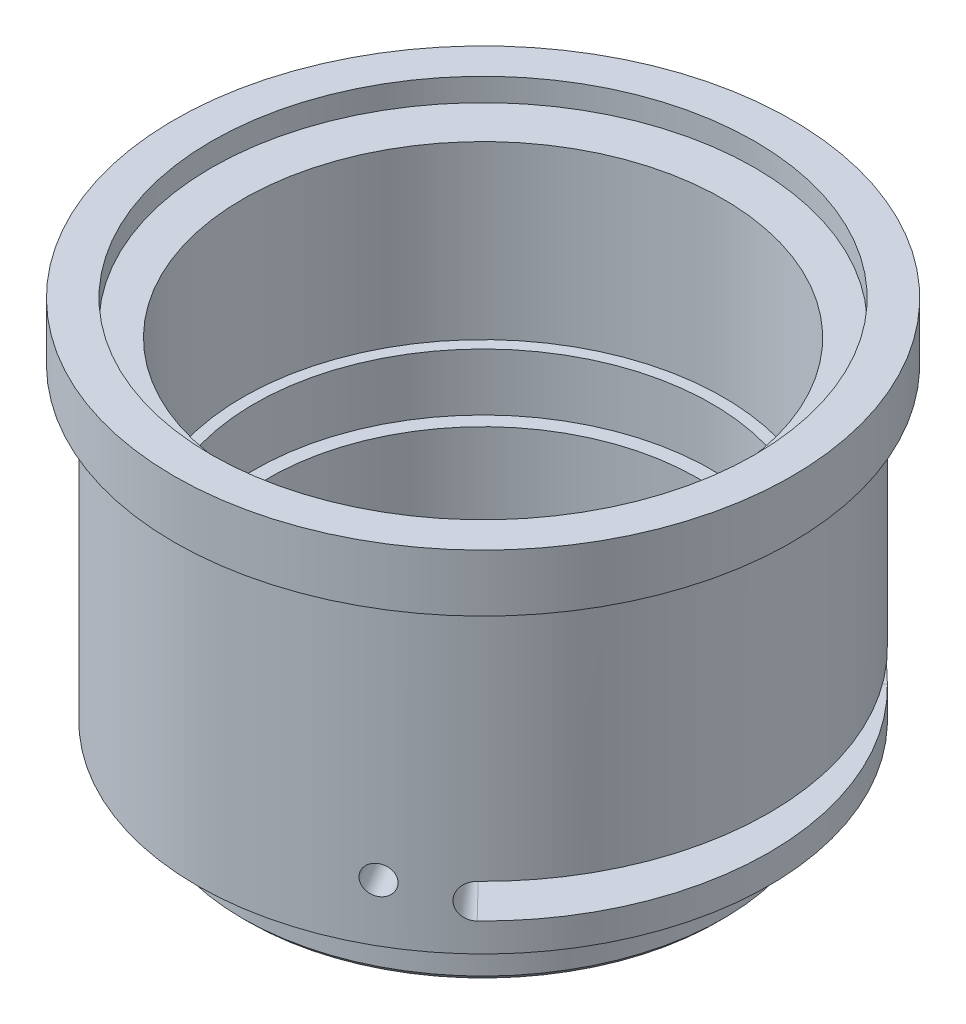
ISO-10303-21;
HEADER;
FILE_DESCRIPTION(('STEP AP214'),'2;1');
FILE_NAME('part.step','',(''),(''),'','','');
FILE_SCHEMA(('AUTOMOTIVE_DESIGN { 1 0 10303 214 1 1 1 1 }'));
ENDSEC;
DATA;
#1=APPLICATION_CONTEXT('core data for automotive mechanical design processes');
#2=APPLICATION_PROTOCOL_DEFINITION('international standard','automotive_design',2000,#1);
#3=PRODUCT_CONTEXT('',#1,'mechanical');
#4=PRODUCT('Part','Part','',(#3));
#5=PRODUCT_RELATED_PRODUCT_CATEGORY('part','',(#4));
#6=PRODUCT_DEFINITION_FORMATION('','',#4);
#7=PRODUCT_DEFINITION_CONTEXT('part definition',#1,'design');
#8=PRODUCT_DEFINITION('design','',#6,#7);
#9=PRODUCT_DEFINITION_SHAPE('','',#8);
#10=(LENGTH_UNIT() NAMED_UNIT(*) SI_UNIT(.MILLI.,.METRE.));
#11=(NAMED_UNIT(*) PLANE_ANGLE_UNIT() SI_UNIT($,.RADIAN.));
#12=(NAMED_UNIT(*) SI_UNIT($,.STERADIAN.) SOLID_ANGLE_UNIT());
#13=UNCERTAINTY_MEASURE_WITH_UNIT(LENGTH_MEASURE(1.E-05),#10,'distance_accuracy_value','');
#14=(GEOMETRIC_REPRESENTATION_CONTEXT(3) GLOBAL_UNCERTAINTY_ASSIGNED_CONTEXT((#13)) GLOBAL_UNIT_ASSIGNED_CONTEXT((#10,
#11,#12)) REPRESENTATION_CONTEXT('',''));
#15=CARTESIAN_POINT('',(0.,0.,0.));
#16=DIRECTION('',(0.,0.,1.));
#17=DIRECTION('',(1.,0.,0.));
#18=AXIS2_PLACEMENT_3D('',#15,#16,#17);
#19=CARTESIAN_POINT('',(0.,34.,0.));
#20=DIRECTION('',(0.,1.,0.));
#21=DIRECTION('',(0.,0.,1.));
#22=AXIS2_PLACEMENT_3D('',#19,#20,#21);
#23=CYLINDRICAL_SURFACE('',#22,23.75);
#24=CARTESIAN_POINT('',(0.,37.,0.));
#25=DIRECTION('',(0.,1.,0.));
#26=DIRECTION('',(0.,0.,1.));
#27=AXIS2_PLACEMENT_3D('',#24,#25,#26);
#28=CIRCLE('',#27,23.75);
#29=CARTESIAN_POINT('',(0.,37.,23.75));
#30=VERTEX_POINT('',#29);
#31=EDGE_CURVE('E430',#30,#30,#28,.T.);
#32=ORIENTED_EDGE('',*,*,#31,.T.);
#33=EDGE_LOOP('',(#32));
#34=FACE_BOUND('',#33,.T.);
#35=CARTESIAN_POINT('',(0.,35.,0.));
#36=DIRECTION('',(0.,-1.,0.));
#37=DIRECTION('',(0.,0.,-1.));
#38=AXIS2_PLACEMENT_3D('',#35,#36,#37);
#39=CIRCLE('',#38,23.75);
#40=CARTESIAN_POINT('',(0.,35.,-23.75));
#41=VERTEX_POINT('',#40);
#42=EDGE_CURVE('E808',#41,#41,#39,.T.);
#43=ORIENTED_EDGE('',*,*,#42,.T.);
#44=EDGE_LOOP('',(#43));
#45=FACE_BOUND('',#44,.T.);
#46=ADVANCED_FACE('F75',(#34,#45),#23,.F.);
#47=CARTESIAN_POINT('',(0.,5.,0.));
#48=DIRECTION('',(0.,-1.,0.));
#49=DIRECTION('',(0.,0.,-1.));
#50=AXIS2_PLACEMENT_3D('',#47,#48,#49);
#51=CYLINDRICAL_SURFACE('',#50,21.);
#52=CARTESIAN_POINT('',(0.,0.499999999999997,0.));
#53=DIRECTION('',(0.,1.,0.));
#54=DIRECTION('',(0.,0.,1.));
#55=AXIS2_PLACEMENT_3D('',#52,#53,#54);
#56=CIRCLE('',#55,21.);
#57=CARTESIAN_POINT('',(0.,0.499999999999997,21.));
#58=VERTEX_POINT('',#57);
#59=EDGE_CURVE('E84',#58,#58,#56,.T.);
#60=ORIENTED_EDGE('',*,*,#59,.T.);
#61=EDGE_LOOP('',(#60));
#62=FACE_BOUND('',#61,.T.);
#63=CARTESIAN_POINT('',(0.,4.,0.));
#64=DIRECTION('',(0.,1.,0.));
#65=DIRECTION('',(0.,0.,1.));
#66=AXIS2_PLACEMENT_3D('',#63,#64,#65);
#67=CIRCLE('',#66,21.);
#68=CARTESIAN_POINT('',(0.,4.,21.));
#69=VERTEX_POINT('',#68);
#70=EDGE_CURVE('E393',#69,#69,#67,.T.);
#71=ORIENTED_EDGE('',*,*,#70,.F.);
#72=EDGE_LOOP('',(#71));
#73=FACE_BOUND('',#72,.T.);
#74=ADVANCED_FACE('F379',(#62,#73),#51,.T.);
#75=CARTESIAN_POINT('',(0.,0.,0.));
#76=DIRECTION('',(0.,1.,0.));
#77=DIRECTION('',(0.,0.,1.));
#78=AXIS2_PLACEMENT_3D('',#75,#76,#77);
#79=PLANE('',#78);
#80=CARTESIAN_POINT('',(0.,0.,0.));
#81=DIRECTION('',(0.,1.,0.));
#82=DIRECTION('',(0.,0.,1.));
#83=AXIS2_PLACEMENT_3D('',#80,#81,#82);
#84=CIRCLE('',#83,20.5);
#85=CARTESIAN_POINT('',(0.,0.,20.5));
#86=VERTEX_POINT('',#85);
#87=EDGE_CURVE('E15',#86,#86,#84,.F.);
#88=ORIENTED_EDGE('',*,*,#87,.T.);
#89=EDGE_LOOP('',(#88));
#90=FACE_BOUND('',#89,.T.);
#91=CARTESIAN_POINT('',(0.,0.,0.));
#92=DIRECTION('',(0.,-1.,0.));
#93=DIRECTION('',(0.,0.,-1.));
#94=AXIS2_PLACEMENT_3D('',#91,#92,#93);
#95=CIRCLE('',#94,18.);
#96=CARTESIAN_POINT('',(0.,0.,-18.));
#97=VERTEX_POINT('',#96);
#98=EDGE_CURVE('E396',#97,#97,#95,.T.);
#99=ORIENTED_EDGE('',*,*,#98,.F.);
#100=EDGE_LOOP('',(#99));
#101=FACE_BOUND('',#100,.T.);
#102=ADVANCED_FACE('F359',(#90,#101),#79,.F.);
#103=CARTESIAN_POINT('',(0.,5.,0.));
#104=DIRECTION('',(0.,1.,0.));
#105=DIRECTION('',(0.,0.,1.));
#106=AXIS2_PLACEMENT_3D('',#103,#104,#105);
#107=PLANE('',#106);
#108=CARTESIAN_POINT('',(0.,5.,0.));
#109=DIRECTION('',(0.,1.,0.));
#110=DIRECTION('',(0.,0.,1.));
#111=AXIS2_PLACEMENT_3D('',#108,#109,#110);
#112=CIRCLE('',#111,25.);
#113=CARTESIAN_POINT('',(0.,5.,25.));
#114=VERTEX_POINT('',#113);
#115=EDGE_CURVE('E442',#114,#114,#112,.T.);
#116=ORIENTED_EDGE('',*,*,#115,.F.);
#117=EDGE_LOOP('',(#116));
#118=FACE_BOUND('',#117,.T.);
#119=CARTESIAN_POINT('',(0.,5.,0.));
#120=DIRECTION('',(0.,1.,0.));
#121=DIRECTION('',(0.,0.,1.));
#122=AXIS2_PLACEMENT_3D('',#119,#120,#121);
#123=CIRCLE('',#122,20.);
#124=CARTESIAN_POINT('',(0.,5.,20.));
#125=VERTEX_POINT('',#124);
#126=EDGE_CURVE('E406',#125,#125,#123,.T.);
#127=ORIENTED_EDGE('',*,*,#126,.T.);
#128=EDGE_LOOP('',(#127));
#129=FACE_BOUND('',#128,.T.);
#130=ADVANCED_FACE('F356',(#118,#129),#107,.F.);
#131=CARTESIAN_POINT('',(0.,32.,0.));
#132=DIRECTION('',(0.,-1.,0.));
#133=DIRECTION('',(0.,0.,-1.));
#134=AXIS2_PLACEMENT_3D('',#131,#132,#133);
#135=CYLINDRICAL_SURFACE('',#134,25.);
#136=CARTESIAN_POINT('',(13.5668969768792,10.,-20.9985548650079));
#137=CARTESIAN_POINT('',(13.5668945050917,10.0701659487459,-20.998556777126));
#138=CARTESIAN_POINT('',(13.5619128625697,10.1403816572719,-21.00177763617));
#139=CARTESIAN_POINT('',(13.5420984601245,10.2788760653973,-21.0145593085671));
#140=CARTESIAN_POINT('',(13.5272540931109,10.3471523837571,-21.0241275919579));
#141=CARTESIAN_POINT('',(13.4881036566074,10.4797417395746,-21.0492659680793));
#142=CARTESIAN_POINT('',(13.4638024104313,10.5440567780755,-21.0648330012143));
#143=CARTESIAN_POINT('',(13.4063793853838,10.6669173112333,-21.1014251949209));
#144=CARTESIAN_POINT('',(13.3732596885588,10.7254641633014,-21.122449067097));
#145=CARTESIAN_POINT('',(13.2990331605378,10.83520309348,-21.1692616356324));
#146=CARTESIAN_POINT('',(13.2579192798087,10.8863886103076,-21.1950545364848));
#147=CARTESIAN_POINT('',(13.168810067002,10.9798959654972,-21.2505338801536));
#148=CARTESIAN_POINT('',(13.1208144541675,11.0222174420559,-21.2802204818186));
#149=CARTESIAN_POINT('',(13.0192028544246,11.0968133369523,-21.3425374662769));
#150=CARTESIAN_POINT('',(12.9655840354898,11.1290826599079,-21.3751693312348));
#151=CARTESIAN_POINT('',(12.8542058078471,11.1826255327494,-21.4423323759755));
#152=CARTESIAN_POINT('',(12.7964464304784,11.2038991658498,-21.4768635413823));
#153=CARTESIAN_POINT('',(12.6784352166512,11.2348294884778,-21.5467393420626));
#154=CARTESIAN_POINT('',(12.6181855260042,11.2444959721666,-21.5820832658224));
#155=CARTESIAN_POINT('',(12.4968407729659,11.2519678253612,-21.6525724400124));
#156=CARTESIAN_POINT('',(12.4357457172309,11.2497732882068,-21.687717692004));
#157=CARTESIAN_POINT('',(12.3145067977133,11.2335935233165,-21.7567871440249));
#158=CARTESIAN_POINT('',(12.2543621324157,11.2196188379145,-21.7907124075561));
#159=CARTESIAN_POINT('',(12.1367025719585,11.180291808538,-21.856463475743));
#160=CARTESIAN_POINT('',(12.0791876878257,11.1549394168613,-21.8882892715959));
#161=CARTESIAN_POINT('',(11.9684408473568,11.09356461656,-21.9490414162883));
#162=CARTESIAN_POINT('',(11.9152108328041,11.0575374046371,-21.9779664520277));
#163=CARTESIAN_POINT('',(11.8146327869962,10.9758391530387,-22.0321973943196));
#164=CARTESIAN_POINT('',(11.7672847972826,10.9301680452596,-22.0575032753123));
#165=CARTESIAN_POINT('',(11.6798345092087,10.8304188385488,-22.1039346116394));
#166=CARTESIAN_POINT('',(11.6397401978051,10.7763315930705,-22.1250554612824));
#167=CARTESIAN_POINT('',(11.5680719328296,10.6613175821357,-22.1626116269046));
#168=CARTESIAN_POINT('',(11.5364979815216,10.6003908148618,-22.1790469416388));
#169=CARTESIAN_POINT('',(11.4828330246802,10.4734216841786,-22.2068787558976));
#170=CARTESIAN_POINT('',(11.4607423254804,10.4073791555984,-22.2182750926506));
#171=CARTESIAN_POINT('',(11.4267261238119,10.2720557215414,-22.2357887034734));
#172=CARTESIAN_POINT('',(11.4148005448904,10.2027748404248,-22.2419060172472));
#173=CARTESIAN_POINT('',(11.4014913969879,10.0630216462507,-22.2487314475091));
#174=CARTESIAN_POINT('',(11.400096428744,9.99255070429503,-22.2494454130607));
#175=CARTESIAN_POINT('',(11.4078616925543,9.85234720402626,-22.2454649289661));
#176=CARTESIAN_POINT('',(11.4170218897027,9.78261464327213,-22.2407704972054));
#177=CARTESIAN_POINT('',(11.4456062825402,9.64590330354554,-22.2260737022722));
#178=CARTESIAN_POINT('',(11.4650252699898,9.5789231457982,-22.2160740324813));
#179=CARTESIAN_POINT('',(11.5135265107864,9.44957546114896,-22.1909767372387));
#180=CARTESIAN_POINT('',(11.5426088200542,9.38720796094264,-22.1758790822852));
#181=CARTESIAN_POINT('',(11.609578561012,9.26879710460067,-22.1408922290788));
#182=CARTESIAN_POINT('',(11.6474735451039,9.2127592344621,-22.1209989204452));
#183=CARTESIAN_POINT('',(11.7309091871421,9.1086535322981,-22.0768655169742));
#184=CARTESIAN_POINT('',(11.7764498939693,9.06058575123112,-22.0526253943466));
#185=CARTESIAN_POINT('',(11.8738578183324,8.97374169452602,-22.000330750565));
#186=CARTESIAN_POINT('',(11.9257306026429,8.93497368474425,-21.9722728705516));
#187=CARTESIAN_POINT('',(12.034231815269,8.86788616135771,-21.9130344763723));
#188=CARTESIAN_POINT('',(12.0908602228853,8.8395666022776,-21.8818539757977));
#189=CARTESIAN_POINT('',(12.2071830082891,8.79419432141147,-21.8171745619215));
#190=CARTESIAN_POINT('',(12.2668759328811,8.77713631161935,-21.7836767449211));
#191=CARTESIAN_POINT('',(12.3876203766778,8.75475402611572,-21.7152406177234));
#192=CARTESIAN_POINT('',(12.4486718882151,8.74942968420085,-21.6803023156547));
#193=CARTESIAN_POINT('',(12.5703181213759,8.75066650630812,-21.6099984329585));
#194=CARTESIAN_POINT('',(12.6309132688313,8.75721470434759,-21.5746333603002));
#195=CARTESIAN_POINT('',(12.7500076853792,8.78198392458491,-21.5044665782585));
#196=CARTESIAN_POINT('',(12.8085069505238,8.80020496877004,-21.4696648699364));
#197=CARTESIAN_POINT('',(12.9217887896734,8.84780000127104,-21.4016761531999));
#198=CARTESIAN_POINT('',(12.9765713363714,8.87717407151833,-21.3684891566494));
#199=CARTESIAN_POINT('',(13.0809249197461,8.94623908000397,-21.3047681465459));
#200=CARTESIAN_POINT('',(13.1304961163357,8.98592970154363,-21.2742340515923));
#201=CARTESIAN_POINT('',(13.223144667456,9.07454753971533,-21.216772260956));
#202=CARTESIAN_POINT('',(13.2662155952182,9.12348379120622,-21.1898481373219));
#203=CARTESIAN_POINT('',(13.3446715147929,9.22919789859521,-21.1405273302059));
#204=CARTESIAN_POINT('',(13.380054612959,9.28597768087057,-21.1181317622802));
#205=CARTESIAN_POINT('',(13.4422188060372,9.40581175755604,-21.0786175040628));
#206=CARTESIAN_POINT('',(13.4689916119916,9.46887202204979,-21.0615038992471));
#207=CARTESIAN_POINT('',(13.5131624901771,9.59938693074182,-21.0331912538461));
#208=CARTESIAN_POINT('',(13.5305716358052,9.66683627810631,-21.0219852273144));
#209=CARTESIAN_POINT('',(13.5509979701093,9.77892057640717,-21.0088204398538));
#210=CARTESIAN_POINT('',(13.5569530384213,9.82282953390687,-21.0049767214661));
#211=CARTESIAN_POINT('',(13.5649033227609,9.91115234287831,-20.9998433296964));
#212=CARTESIAN_POINT('',(13.5668985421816,9.95556619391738,-20.9985536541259));
#213=CARTESIAN_POINT('',(13.5668969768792,10.,-20.9985548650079));
#214=B_SPLINE_CURVE_WITH_KNOTS('',3,(#136,#137,#138,#139,#140,#141,#142,#143,#144,#145,#146,
#147,#148,#149,#150,#151,#152,#153,#154,#155,#156,#157,#158,#159,#160,#161,#162,#163,#164,#165,
#166,#167,#168,#169,#170,#171,#172,#173,#174,#175,#176,#177,#178,#179,#180,#181,#182,#183,#184,
#185,#186,#187,#188,#189,#190,#191,#192,#193,#194,#195,#196,#197,#198,#199,#200,#201,#202,#203,
#204,#205,#206,#207,#208,#209,#210,#211,#212,#213),.UNSPECIFIED.,.T.,.F.,(4,2,2,2,2,2,2,2,2,2,2,
2,2,2,2,2,2,2,2,2,2,2,2,2,2,2,2,2,2,2,2,2,2,2,2,2,2,2,4),(0.,0.210335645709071,
0.420919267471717,0.631395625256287,0.841822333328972,1.05243545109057,1.26305716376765,
1.47378546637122,1.68451217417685,1.89506094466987,2.10560805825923,2.31596694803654,
2.52632671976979,2.73678129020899,2.94723734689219,3.15792374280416,3.36861019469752,
3.57930345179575,3.7899951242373,4.00045869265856,4.21092156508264,4.42127769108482,
4.63163503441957,4.84217332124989,5.05271295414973,5.26343903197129,5.47416419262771,
5.68479033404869,5.89541528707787,6.10581035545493,6.31620582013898,6.52660283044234,
6.73699338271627,6.94759060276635,7.15823963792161,7.36909085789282,7.57969217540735,
7.71289099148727,7.84608969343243),.UNSPECIFIED.);
#215=CARTESIAN_POINT('',(13.5668969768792,10.,-20.9985548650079));
#216=VERTEX_POINT('',#215);
#217=EDGE_CURVE('E330',#216,#216,#214,.T.);
#218=ORIENTED_EDGE('',*,*,#217,.T.);
#219=EDGE_LOOP('',(#218));
#220=FACE_BOUND('',#219,.T.);
#221=CARTESIAN_POINT('',(11.4018334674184,10.,22.2485548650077));
#222=CARTESIAN_POINT('',(11.401836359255,10.0701659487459,22.248553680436));
#223=CARTESIAN_POINT('',(11.4071165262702,10.1403816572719,22.2458498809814));
#224=CARTESIAN_POINT('',(11.4280929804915,10.2788760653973,22.2350809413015));
#225=CARTESIAN_POINT('',(11.4438015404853,10.3471523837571,22.2270094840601));
#226=CARTESIAN_POINT('',(11.4851472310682,10.4797417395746,22.2056733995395));
#227=CARTESIAN_POINT('',(11.5107793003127,10.5440567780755,22.1924114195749));
#228=CARTESIAN_POINT('',(11.5711805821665,10.6669173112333,22.1609777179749));
#229=CARTESIAN_POINT('',(11.6059476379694,10.7254641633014,22.1428071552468));
#230=CARTESIAN_POINT('',(11.683601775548,10.83520309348,22.1019313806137));
#231=CARTESIAN_POINT('',(11.726496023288,10.8863886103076,22.0792221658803));
#232=CARTESIAN_POINT('',(11.8190971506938,10.9798959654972,22.0297909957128));
#233=CARTESIAN_POINT('',(11.868804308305,11.0222174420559,22.0030688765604));
#234=CARTESIAN_POINT('',(11.9735781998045,11.0968133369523,21.9462291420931));
#235=CARTESIAN_POINT('',(12.0286476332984,11.1290826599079,21.9161098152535));
#236=CARTESIAN_POINT('',(12.1425016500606,11.1826255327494,21.8532349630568));
#237=CARTESIAN_POINT('',(12.2012862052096,11.2038991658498,21.8204794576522));
#238=CARTESIAN_POINT('',(12.3208060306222,11.2348294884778,21.7532166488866));
#239=CARTESIAN_POINT('',(12.381539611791,11.2444959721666,21.718710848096));
#240=CARTESIAN_POINT('',(12.5032574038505,11.2519678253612,21.6488677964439));
#241=CARTESIAN_POINT('',(12.5642416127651,11.2497732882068,21.6135305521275));
#242=CARTESIAN_POINT('',(12.6846769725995,11.2335935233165,21.5430692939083));
#243=CARTESIAN_POINT('',(12.7441294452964,11.2196188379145,21.5079451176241));
#244=CARTESIAN_POINT('',(12.8599013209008,11.180291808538,21.4389244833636));
#245=CARTESIAN_POINT('',(12.9162207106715,11.1549394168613,21.4050280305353));
#246=CARTESIAN_POINT('',(13.024207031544,11.09356461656,21.3394945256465));
#247=CARTESIAN_POINT('',(13.075871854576,11.0575374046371,21.3078584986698));
#248=CARTESIAN_POINT('',(13.1731262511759,10.9758391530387,21.2478708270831));
#249=CARTESIAN_POINT('',(13.2187157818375,10.9301680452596,21.2195192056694));
#250=CARTESIAN_POINT('',(13.3026516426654,10.8304188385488,21.1670007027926));
#251=CARTESIAN_POINT('',(13.3409899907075,10.7763315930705,21.1428384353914));
#252=CARTESIAN_POINT('',(13.4093487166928,10.6613175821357,21.0995499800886));
#253=CARTESIAN_POINT('',(13.4393690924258,10.6003908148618,21.0804237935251));
#254=CARTESIAN_POINT('',(13.4903046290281,10.4734216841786,21.0478644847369));
#255=CARTESIAN_POINT('',(13.5112194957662,10.4073791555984,21.0344315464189));
#256=CARTESIAN_POINT('',(13.543394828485,10.2720557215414,21.0137294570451));
#257=CARTESIAN_POINT('',(13.5546553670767,10.2027748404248,21.0064602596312));
#258=CARTESIAN_POINT('',(13.5672209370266,10.0630216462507,20.9983469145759));
#259=CARTESIAN_POINT('',(13.5685367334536,9.99255070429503,20.997495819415));
#260=CARTESIAN_POINT('',(13.5612069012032,9.85234720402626,21.0022304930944));
#261=CARTESIAN_POINT('',(13.5525613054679,9.78261464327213,21.0078162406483));
#262=CARTESIAN_POINT('',(13.5255413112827,9.64590330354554,21.0252226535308));
#263=CARTESIAN_POINT('',(13.5071718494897,9.5789231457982,21.0370401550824));
#264=CARTESIAN_POINT('',(13.4611863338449,9.44957546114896,21.066494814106));
#265=CARTESIAN_POINT('',(13.4335702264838,9.38720796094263,21.0841320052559));
#266=CARTESIAN_POINT('',(13.3697858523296,9.26879710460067,21.1246360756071));
#267=CARTESIAN_POINT('',(13.3336102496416,9.2127592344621,21.1475074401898));
#268=CARTESIAN_POINT('',(13.2536717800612,9.1086535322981,21.1976981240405));
#269=CARTESIAN_POINT('',(13.2099088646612,9.06058575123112,21.2250174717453));
#270=CARTESIAN_POINT('',(13.115916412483,8.97374169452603,21.2832278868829));
#271=CARTESIAN_POINT('',(13.0656811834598,8.93497368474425,21.3141220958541));
#272=CARTESIAN_POINT('',(12.960128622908,8.86788616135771,21.3784677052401));
#273=CARTESIAN_POINT('',(12.9048113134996,8.8395666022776,21.4119190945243));
#274=CARTESIAN_POINT('',(12.790635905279,8.79419432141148,21.4803178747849));
#275=CARTESIAN_POINT('',(12.7317794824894,8.77713631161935,21.5152645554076));
#276=CARTESIAN_POINT('',(12.6121398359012,8.75475402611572,21.5856142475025));
#277=CARTESIAN_POINT('',(12.5513566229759,8.74942968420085,21.6210172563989));
#278=CARTESIAN_POINT('',(12.4296485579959,8.75066650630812,21.6912140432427));
#279=CARTESIAN_POINT('',(12.3687239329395,8.75721470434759,21.726008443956));
#280=CARTESIAN_POINT('',(12.2484105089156,8.78198392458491,21.7940638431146));
#281=CARTESIAN_POINT('',(12.1890217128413,8.80020496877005,21.8273248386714));
#282=CARTESIAN_POINT('',(12.0735008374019,8.84780000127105,21.8914354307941));
#283=CARTESIAN_POINT('',(12.0173687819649,8.87717407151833,21.9222850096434));
#284=CARTESIAN_POINT('',(11.9100079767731,8.94623908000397,21.9807973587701));
#285=CARTESIAN_POINT('',(11.8587790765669,8.98592970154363,22.0084602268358));
#286=CARTESIAN_POINT('',(11.7626914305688,9.07454753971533,22.0599653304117));
#287=CARTESIAN_POINT('',(11.7178389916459,9.12348379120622,22.0838037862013));
#288=CARTESIAN_POINT('',(11.635897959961,9.22919789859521,22.1270882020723));
#289=CARTESIAN_POINT('',(11.5988112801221,9.28597768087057,22.1465330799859));
#290=CARTESIAN_POINT('',(11.533508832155,9.40581175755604,22.1806117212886));
#291=CARTESIAN_POINT('',(11.5053016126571,9.46887202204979,22.1952408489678));
#292=CARTESIAN_POINT('',(11.4586967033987,9.59938693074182,22.2193376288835));
#293=CARTESIAN_POINT('',(11.4402874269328,9.66683627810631,22.2288113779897));
#294=CARTESIAN_POINT('',(11.4186732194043,9.77892057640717,22.239918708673));
#295=CARTESIAN_POINT('',(11.4123669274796,9.82282953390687,22.2431540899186));
#296=CARTESIAN_POINT('',(11.4039461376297,9.91115234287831,22.2474725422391));
#297=CARTESIAN_POINT('',(11.4018316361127,9.95556619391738,22.2485556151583));
#298=CARTESIAN_POINT('',(11.4018334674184,10.,22.2485548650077));
#299=B_SPLINE_CURVE_WITH_KNOTS('',3,(#221,#222,#223,#224,#225,#226,#227,#228,#229,#230,#231,
#232,#233,#234,#235,#236,#237,#238,#239,#240,#241,#242,#243,#244,#245,#246,#247,#248,#249,#250,
#251,#252,#253,#254,#255,#256,#257,#258,#259,#260,#261,#262,#263,#264,#265,#266,#267,#268,#269,
#270,#271,#272,#273,#274,#275,#276,#277,#278,#279,#280,#281,#282,#283,#284,#285,#286,#287,#288,
#289,#290,#291,#292,#293,#294,#295,#296,#297,#298),.UNSPECIFIED.,.T.,.F.,(4,2,2,2,2,2,2,2,2,2,2,
2,2,2,2,2,2,2,2,2,2,2,2,2,2,2,2,2,2,2,2,2,2,2,2,2,2,2,4),(0.,0.210335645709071,
0.420919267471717,0.631395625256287,0.841822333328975,1.05243545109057,1.26305716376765,
1.47378546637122,1.68451217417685,1.89506094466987,2.10560805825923,2.31596694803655,
2.52632671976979,2.73678129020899,2.94723734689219,3.15792374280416,3.36861019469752,
3.57930345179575,3.7899951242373,4.00045869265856,4.21092156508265,4.42127769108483,
4.63163503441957,4.84217332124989,5.05271295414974,5.26343903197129,5.47416419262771,
5.68479033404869,5.89541528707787,6.10581035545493,6.31620582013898,6.52660283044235,
6.73699338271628,6.94759060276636,7.15823963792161,7.36909085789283,7.57969217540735,
7.71289099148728,7.84608969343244),.UNSPECIFIED.);
#300=CARTESIAN_POINT('',(11.4018334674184,10.,22.2485548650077));
#301=VERTEX_POINT('',#300);
#302=EDGE_CURVE('E329',#301,#301,#299,.T.);
#303=ORIENTED_EDGE('',*,*,#302,.T.);
#304=EDGE_LOOP('',(#303));
#305=FACE_BOUND('',#304,.T.);
#306=CARTESIAN_POINT('',(-24.9687304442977,10.,-1.24999999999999));
#307=CARTESIAN_POINT('',(-24.9687308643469,10.0701659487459,-1.24999690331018));
#308=CARTESIAN_POINT('',(-24.96902938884,10.1403816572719,-1.24407224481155));
#309=CARTESIAN_POINT('',(-24.9701914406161,10.2788760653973,-1.22052163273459));
#310=CARTESIAN_POINT('',(-24.9710556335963,10.3471523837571,-1.20288189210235));
#311=CARTESIAN_POINT('',(-24.9732508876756,10.4797417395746,-1.15640743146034));
#312=CARTESIAN_POINT('',(-24.974581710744,10.5440567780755,-1.12757841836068));
#313=CARTESIAN_POINT('',(-24.9775599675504,10.6669173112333,-1.05955252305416));
#314=CARTESIAN_POINT('',(-24.9792073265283,10.7254641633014,-1.02035808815));
#315=CARTESIAN_POINT('',(-24.9826349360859,10.83520309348,-0.932669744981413));
#316=CARTESIAN_POINT('',(-24.9844153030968,10.8863886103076,-0.884167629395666));
#317=CARTESIAN_POINT('',(-24.9879072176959,10.9798959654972,-0.779257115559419));
#318=CARTESIAN_POINT('',(-24.9896187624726,11.0222174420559,-0.722848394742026));
#319=CARTESIAN_POINT('',(-24.9927810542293,11.0968133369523,-0.603691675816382));
#320=CARTESIAN_POINT('',(-24.9942316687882,11.1290826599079,-0.540940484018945));
#321=CARTESIAN_POINT('',(-24.9967074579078,11.1826255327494,-0.410902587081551));
#322=CARTESIAN_POINT('',(-24.9977326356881,11.2038991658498,-0.343615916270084));
#323=CARTESIAN_POINT('',(-24.9992412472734,11.2348294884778,-0.206477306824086));
#324=CARTESIAN_POINT('',(-24.9997251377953,11.2444959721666,-0.136627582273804));
#325=CARTESIAN_POINT('',(-25.0000981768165,11.2519678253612,0.00370464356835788));
#326=CARTESIAN_POINT('',(-24.9999873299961,11.2497732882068,0.0741871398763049));
#327=CARTESIAN_POINT('',(-24.9991837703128,11.2335935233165,0.213717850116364));
#328=CARTESIAN_POINT('',(-24.9984915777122,11.2196188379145,0.282767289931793));
#329=CARTESIAN_POINT('',(-24.9966038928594,11.180291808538,0.417538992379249));
#330=CARTESIAN_POINT('',(-24.9954083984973,11.1549394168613,0.483261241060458));
#331=CARTESIAN_POINT('',(-24.9926478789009,11.09356461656,0.609546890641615));
#332=CARTESIAN_POINT('',(-24.9910826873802,11.0575374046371,0.670107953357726));
#333=CARTESIAN_POINT('',(-24.9877590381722,10.9758391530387,0.784326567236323));
#334=CARTESIAN_POINT('',(-24.9860005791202,10.9301680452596,0.837984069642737));
#335=CARTESIAN_POINT('',(-24.9824861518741,10.8304188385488,0.936933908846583));
#336=CARTESIAN_POINT('',(-24.9807301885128,10.7763315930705,0.982217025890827));
#337=CARTESIAN_POINT('',(-24.9774206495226,10.6613175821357,1.06306164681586));
#338=CARTESIAN_POINT('',(-24.9758670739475,10.6003908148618,1.09862314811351));
#339=CARTESIAN_POINT('',(-24.9731376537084,10.4734216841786,1.15901427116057));
#340=CARTESIAN_POINT('',(-24.9719618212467,10.4073791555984,1.1838435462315));
#341=CARTESIAN_POINT('',(-24.9701209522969,10.2720557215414,1.22205924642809));
#342=CARTESIAN_POINT('',(-24.9694559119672,10.2027748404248,1.23544575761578));
#343=CARTESIAN_POINT('',(-24.9687123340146,10.0630216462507,1.25038453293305));
#344=CARTESIAN_POINT('',(-24.9686331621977,9.99255070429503,1.25194959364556));
#345=CARTESIAN_POINT('',(-24.9690685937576,9.85234720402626,1.2432344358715));
#346=CARTESIAN_POINT('',(-24.9695831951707,9.78261464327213,1.23295425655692));
#347=CARTESIAN_POINT('',(-24.9711475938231,9.64590330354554,1.20085104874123));
#348=CARTESIAN_POINT('',(-24.9721971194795,9.5789231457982,1.17903387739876));
#349=CARTESIAN_POINT('',(-24.9747128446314,9.44957546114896,1.1244819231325));
#350=CARTESIAN_POINT('',(-24.976179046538,9.38720796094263,1.09174707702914));
#351=CARTESIAN_POINT('',(-24.9793644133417,9.26879710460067,1.01625615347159));
#352=CARTESIAN_POINT('',(-24.9810837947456,9.2127592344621,0.973491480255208));
#353=CARTESIAN_POINT('',(-24.9845809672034,9.1086535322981,0.879167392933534));
#354=CARTESIAN_POINT('',(-24.9863587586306,9.06058575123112,0.827607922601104));
#355=CARTESIAN_POINT('',(-24.9897742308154,8.97374169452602,0.717102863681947));
#356=CARTESIAN_POINT('',(-24.9914117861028,8.93497368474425,0.658150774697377));
#357=CARTESIAN_POINT('',(-24.9943604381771,8.86788616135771,0.534566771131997));
#358=CARTESIAN_POINT('',(-24.995671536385,8.8395666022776,0.469934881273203));
#359=CARTESIAN_POINT('',(-24.9978189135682,8.79419432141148,0.336856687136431));
#360=CARTESIAN_POINT('',(-24.9986554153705,8.77713631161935,0.26841218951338));
#361=CARTESIAN_POINT('',(-24.999760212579,8.75475402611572,0.129626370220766));
#362=CARTESIAN_POINT('',(-25.0000285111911,8.74942968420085,0.059285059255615));
#363=CARTESIAN_POINT('',(-24.9999666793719,8.75066650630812,-0.0812156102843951));
#364=CARTESIAN_POINT('',(-24.9996372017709,8.75721470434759,-0.151375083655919));
#365=CARTESIAN_POINT('',(-24.9984181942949,8.78198392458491,-0.289597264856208));
#366=CARTESIAN_POINT('',(-24.9975286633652,8.80020496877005,-0.35765996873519));
#367=CARTESIAN_POINT('',(-24.9952896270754,8.84780000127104,-0.489759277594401));
#368=CARTESIAN_POINT('',(-24.9939401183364,8.87717407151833,-0.553795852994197));
#369=CARTESIAN_POINT('',(-24.9909328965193,8.94623908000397,-0.676029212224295));
#370=CARTESIAN_POINT('',(-24.9892751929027,8.98592970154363,-0.734226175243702));
#371=CARTESIAN_POINT('',(-24.9858360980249,9.07454753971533,-0.843193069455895));
#372=CARTESIAN_POINT('',(-24.9840545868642,9.12348379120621,-0.893955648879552));
#373=CARTESIAN_POINT('',(-24.980569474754,9.22919789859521,-0.986560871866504));
#374=CARTESIAN_POINT('',(-24.9788658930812,9.28597768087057,-1.02840131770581));
#375=CARTESIAN_POINT('',(-24.9757276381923,9.40581175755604,-1.10199421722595));
#376=CARTESIAN_POINT('',(-24.9742932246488,9.46887202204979,-1.13373694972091));
#377=CARTESIAN_POINT('',(-24.971859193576,9.59938693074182,-1.18614637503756));
#378=CARTESIAN_POINT('',(-24.9708590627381,9.66683627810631,-1.20682615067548));
#379=CARTESIAN_POINT('',(-24.9696711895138,9.77892057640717,-1.23109826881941));
#380=CARTESIAN_POINT('',(-24.969319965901,9.82282953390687,-1.2381773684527));
#381=CARTESIAN_POINT('',(-24.9688494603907,9.91115234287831,-1.24762921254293));
#382=CARTESIAN_POINT('',(-24.9687301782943,9.95556619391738,-1.25000196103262));
#383=CARTESIAN_POINT('',(-24.9687304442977,10.,-1.24999999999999));
#384=B_SPLINE_CURVE_WITH_KNOTS('',3,(#306,#307,#308,#309,#310,#311,#312,#313,#314,#315,#316,
#317,#318,#319,#320,#321,#322,#323,#324,#325,#326,#327,#328,#329,#330,#331,#332,#333,#334,#335,
#336,#337,#338,#339,#340,#341,#342,#343,#344,#345,#346,#347,#348,#349,#350,#351,#352,#353,#354,
#355,#356,#357,#358,#359,#360,#361,#362,#363,#364,#365,#366,#367,#368,#369,#370,#371,#372,#373,
#374,#375,#376,#377,#378,#379,#380,#381,#382,#383),.UNSPECIFIED.,.T.,.F.,(4,2,2,2,2,2,2,2,2,2,2,
2,2,2,2,2,2,2,2,2,2,2,2,2,2,2,2,2,2,2,2,2,2,2,2,2,2,2,4),(0.,0.210335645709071,
0.420919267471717,0.631395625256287,0.841822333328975,1.05243545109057,1.26305716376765,
1.47378546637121,1.68451217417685,1.89506094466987,2.10560805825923,2.31596694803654,
2.52632671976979,2.73678129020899,2.94723734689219,3.15792374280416,3.36861019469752,
3.57930345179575,3.7899951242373,4.00045869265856,4.21092156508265,4.42127769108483,
4.63163503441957,4.84217332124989,5.05271295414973,5.26343903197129,5.47416419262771,
5.68479033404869,5.89541528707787,6.10581035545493,6.31620582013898,6.52660283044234,
6.73699338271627,6.94759060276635,7.15823963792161,7.36909085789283,7.57969217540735,
7.71289099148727,7.84608969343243),.UNSPECIFIED.);
#385=CARTESIAN_POINT('',(-24.9687304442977,10.,-1.24999999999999));
#386=VERTEX_POINT('',#385);
#387=EDGE_CURVE('E171',#386,#386,#384,.T.);
#388=ORIENTED_EDGE('',*,*,#387,.T.);
#389=EDGE_LOOP('',(#388));
#390=FACE_BOUND('',#389,.T.);
#391=CARTESIAN_POINT('',(0.,10.5,0.));
#392=DIRECTION('',(0.,-1.,0.));
#393=DIRECTION('',(0.696706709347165,0.,0.717356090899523));
#394=AXIS2_PLACEMENT_3D('',#391,#392,#393);
#395=CIRCLE('',#394,25.);
#396=CARTESIAN_POINT('',(17.4176677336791,10.5,-17.9339022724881));
#397=VERTEX_POINT('',#396);
#398=CARTESIAN_POINT('',(17.4176677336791,10.5,17.9339022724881));
#399=VERTEX_POINT('',#398);
#400=EDGE_CURVE('E138',#397,#399,#395,.T.);
#401=ORIENTED_EDGE('',*,*,#400,.F.);
#402=CARTESIAN_POINT('',(17.4176677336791,7.5,-17.9339022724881));
#403=CARTESIAN_POINT('',(17.1323888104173,7.50076539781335,-18.2109693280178));
#404=CARTESIAN_POINT('',(16.8512496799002,7.65809178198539,-18.469285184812));
#405=CARTESIAN_POINT('',(16.4314530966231,8.22058787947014,-18.84373795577));
#406=CARTESIAN_POINT('',(16.3110371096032,8.60252981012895,-18.9459776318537));
#407=CARTESIAN_POINT('',(16.3108362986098,9.3974701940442,-18.9461505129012));
#408=CARTESIAN_POINT('',(16.4314670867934,9.77939336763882,-18.8437254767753));
#409=CARTESIAN_POINT('',(16.8512356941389,10.341926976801,-18.469297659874));
#410=CARTESIAN_POINT('',(17.1328769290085,10.4998007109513,-18.2104952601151));
#411=CARTESIAN_POINT('',(17.4176677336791,10.5,-17.9339022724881));
#412=B_SPLINE_CURVE_WITH_KNOTS('',3,(#402,#403,#404,#405,#406,#407,#408,#409,#410,#411),
.UNSPECIFIED.,.F.,.F.,(4,2,2,2,4),(0.,0.25,0.5,0.75,1.),.UNSPECIFIED.);
#413=CARTESIAN_POINT('',(17.4176677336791,7.5,-17.9339022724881));
#414=VERTEX_POINT('',#413);
#415=EDGE_CURVE('E149',#414,#397,#412,.T.);
#416=ORIENTED_EDGE('',*,*,#415,.F.);
#417=CARTESIAN_POINT('',(0.,7.49999999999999,0.));
#418=DIRECTION('',(0.,-1.,0.));
#419=DIRECTION('',(0.696706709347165,0.,0.717356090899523));
#420=AXIS2_PLACEMENT_3D('',#417,#418,#419);
#421=CIRCLE('',#420,25.);
#422=CARTESIAN_POINT('',(17.4176677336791,7.49999999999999,17.9339022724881));
#423=VERTEX_POINT('',#422);
#424=EDGE_CURVE('E157',#414,#423,#421,.T.);
#425=ORIENTED_EDGE('',*,*,#424,.T.);
#426=CARTESIAN_POINT('',(17.4176677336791,10.5,17.9339022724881));
#427=CARTESIAN_POINT('',(17.132388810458,10.4992346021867,18.2109693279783));
#428=CARTESIAN_POINT('',(16.8512496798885,10.3419082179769,18.4692851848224));
#429=CARTESIAN_POINT('',(16.4314530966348,9.77941212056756,18.8437379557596));
#430=CARTESIAN_POINT('',(16.3110371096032,9.39747018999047,18.9459776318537));
#431=CARTESIAN_POINT('',(16.3108362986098,8.60252980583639,18.9461505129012));
#432=CARTESIAN_POINT('',(16.4314670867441,8.22060663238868,18.8437254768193));
#433=CARTESIAN_POINT('',(16.8512356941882,7.65807302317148,18.46929765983));
#434=CARTESIAN_POINT('',(17.1328769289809,7.50019928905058,18.210495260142));
#435=CARTESIAN_POINT('',(17.4176677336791,7.49999999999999,17.9339022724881));
#436=B_SPLINE_CURVE_WITH_KNOTS('',3,(#426,#427,#428,#429,#430,#431,#432,#433,#434,#435),
.UNSPECIFIED.,.F.,.F.,(4,2,2,2,4),(0.,0.25,0.5,0.75,1.),.UNSPECIFIED.);
#437=EDGE_CURVE('E95',#399,#423,#436,.T.);
#438=ORIENTED_EDGE('',*,*,#437,.F.);
#439=EDGE_LOOP('',(#401,#416,#425,#438));
#440=FACE_BOUND('',#439,.T.);
#441=CARTESIAN_POINT('',(0.,32.,0.));
#442=DIRECTION('',(0.,1.,0.));
#443=DIRECTION('',(0.,0.,1.));
#444=AXIS2_PLACEMENT_3D('',#441,#442,#443);
#445=CIRCLE('',#444,25.);
#446=CARTESIAN_POINT('',(0.,32.,25.));
#447=VERTEX_POINT('',#446);
#448=EDGE_CURVE('E446',#447,#447,#445,.T.);
#449=ORIENTED_EDGE('',*,*,#448,.F.);
#450=EDGE_LOOP('',(#449));
#451=FACE_BOUND('',#450,.T.);
#452=ORIENTED_EDGE('',*,*,#115,.T.);
#453=EDGE_LOOP('',(#452));
#454=FACE_BOUND('',#453,.T.);
#455=ADVANCED_FACE('F160',(#220,#305,#390,#440,#451,#454),#135,.T.);
#456=CARTESIAN_POINT('',(0.,32.,0.));
#457=DIRECTION('',(0.,1.,0.));
#458=DIRECTION('',(0.,0.,1.));
#459=AXIS2_PLACEMENT_3D('',#456,#457,#458);
#460=PLANE('',#459);
#461=CARTESIAN_POINT('',(0.,32.,0.));
#462=DIRECTION('',(0.,1.,0.));
#463=DIRECTION('',(0.,0.,1.));
#464=AXIS2_PLACEMENT_3D('',#461,#462,#463);
#465=CIRCLE('',#464,27.);
#466=CARTESIAN_POINT('',(0.,32.,27.));
#467=VERTEX_POINT('',#466);
#468=EDGE_CURVE('E437',#467,#467,#465,.T.);
#469=ORIENTED_EDGE('',*,*,#468,.F.);
#470=EDGE_LOOP('',(#469));
#471=FACE_BOUND('',#470,.T.);
#472=ORIENTED_EDGE('',*,*,#448,.T.);
#473=EDGE_LOOP('',(#472));
#474=FACE_BOUND('',#473,.T.);
#475=ADVANCED_FACE('F355',(#471,#474),#460,.F.);
#476=CARTESIAN_POINT('',(0.,37.,0.));
#477=DIRECTION('',(0.,-1.,0.));
#478=DIRECTION('',(0.,0.,-1.));
#479=AXIS2_PLACEMENT_3D('',#476,#477,#478);
#480=CYLINDRICAL_SURFACE('',#479,27.);
#481=CARTESIAN_POINT('',(0.,37.,0.));
#482=DIRECTION('',(0.,1.,0.));
#483=DIRECTION('',(0.,0.,1.));
#484=AXIS2_PLACEMENT_3D('',#481,#482,#483);
#485=CIRCLE('',#484,27.);
#486=CARTESIAN_POINT('',(0.,37.,27.));
#487=VERTEX_POINT('',#486);
#488=EDGE_CURVE('E438',#487,#487,#485,.T.);
#489=ORIENTED_EDGE('',*,*,#488,.F.);
#490=EDGE_LOOP('',(#489));
#491=FACE_BOUND('',#490,.T.);
#492=ORIENTED_EDGE('',*,*,#468,.T.);
#493=EDGE_LOOP('',(#492));
#494=FACE_BOUND('',#493,.T.);
#495=ADVANCED_FACE('F648',(#491,#494),#480,.T.);
#496=CARTESIAN_POINT('',(0.,37.,0.));
#497=DIRECTION('',(0.,1.,0.));
#498=DIRECTION('',(0.,0.,1.));
#499=AXIS2_PLACEMENT_3D('',#496,#497,#498);
#500=PLANE('',#499);
#501=ORIENTED_EDGE('',*,*,#31,.F.);
#502=EDGE_LOOP('',(#501));
#503=FACE_BOUND('',#502,.T.);
#504=ORIENTED_EDGE('',*,*,#488,.T.);
#505=EDGE_LOOP('',(#504));
#506=FACE_BOUND('',#505,.T.);
#507=ADVANCED_FACE('F638',(#503,#506),#500,.T.);
#508=CARTESIAN_POINT('',(0.,34.,0.));
#509=DIRECTION('',(0.,1.,0.));
#510=DIRECTION('',(0.,0.,1.));
#511=AXIS2_PLACEMENT_3D('',#508,#509,#510);
#512=PLANE('',#511);
#513=CARTESIAN_POINT('',(0.,34.,0.));
#514=DIRECTION('',(0.,1.,0.));
#515=DIRECTION('',(0.,0.,1.));
#516=AXIS2_PLACEMENT_3D('',#513,#514,#515);
#517=CIRCLE('',#516,21.);
#518=CARTESIAN_POINT('',(0.,34.,21.));
#519=VERTEX_POINT('',#518);
#520=EDGE_CURVE('E422',#519,#519,#517,.T.);
#521=ORIENTED_EDGE('',*,*,#520,.F.);
#522=EDGE_LOOP('',(#521));
#523=FACE_BOUND('',#522,.T.);
#524=CARTESIAN_POINT('',(0.,34.,0.));
#525=DIRECTION('',(0.,-1.,0.));
#526=DIRECTION('',(0.,0.,-1.));
#527=AXIS2_PLACEMENT_3D('',#524,#525,#526);
#528=CIRCLE('',#527,25.25);
#529=CARTESIAN_POINT('',(0.,34.,-25.25));
#530=VERTEX_POINT('',#529);
#531=EDGE_CURVE('E817',#530,#530,#528,.T.);
#532=ORIENTED_EDGE('',*,*,#531,.F.);
#533=EDGE_LOOP('',(#532));
#534=FACE_BOUND('',#533,.T.);
#535=ADVANCED_FACE('F628',(#523,#534),#512,.T.);
#536=CARTESIAN_POINT('',(0.,19.,0.));
#537=DIRECTION('',(0.,1.,0.));
#538=DIRECTION('',(0.,0.,1.));
#539=AXIS2_PLACEMENT_3D('',#536,#537,#538);
#540=CYLINDRICAL_SURFACE('',#539,21.);
#541=CARTESIAN_POINT('',(0.,19.,0.));
#542=DIRECTION('',(0.,1.,0.));
#543=DIRECTION('',(0.,0.,1.));
#544=AXIS2_PLACEMENT_3D('',#541,#542,#543);
#545=CIRCLE('',#544,21.);
#546=CARTESIAN_POINT('',(0.,19.,21.));
#547=VERTEX_POINT('',#546);
#548=EDGE_CURVE('E426',#547,#547,#545,.T.);
#549=ORIENTED_EDGE('',*,*,#548,.F.);
#550=EDGE_LOOP('',(#549));
#551=FACE_BOUND('',#550,.T.);
#552=ORIENTED_EDGE('',*,*,#520,.T.);
#553=EDGE_LOOP('',(#552));
#554=FACE_BOUND('',#553,.T.);
#555=ADVANCED_FACE('F618',(#551,#554),#540,.F.);
#556=CARTESIAN_POINT('',(0.,19.,0.));
#557=DIRECTION('',(0.,1.,0.));
#558=DIRECTION('',(0.,0.,1.));
#559=AXIS2_PLACEMENT_3D('',#556,#557,#558);
#560=PLANE('',#559);
#561=CARTESIAN_POINT('',(0.,19.,0.));
#562=DIRECTION('',(0.,1.,0.));
#563=DIRECTION('',(0.,0.,1.));
#564=AXIS2_PLACEMENT_3D('',#561,#562,#563);
#565=CIRCLE('',#564,20.);
#566=CARTESIAN_POINT('',(0.,19.,20.));
#567=VERTEX_POINT('',#566);
#568=EDGE_CURVE('E413',#567,#567,#565,.T.);
#569=ORIENTED_EDGE('',*,*,#568,.F.);
#570=EDGE_LOOP('',(#569));
#571=FACE_BOUND('',#570,.T.);
#572=ORIENTED_EDGE('',*,*,#548,.T.);
#573=EDGE_LOOP('',(#572));
#574=FACE_BOUND('',#573,.T.);
#575=ADVANCED_FACE('F609',(#571,#574),#560,.T.);
#576=CARTESIAN_POINT('',(0.,14.,0.));
#577=DIRECTION('',(0.,1.,0.));
#578=DIRECTION('',(0.,0.,1.));
#579=AXIS2_PLACEMENT_3D('',#576,#577,#578);
#580=CYLINDRICAL_SURFACE('',#579,20.);
#581=CARTESIAN_POINT('',(0.,14.,0.));
#582=DIRECTION('',(0.,1.,0.));
#583=DIRECTION('',(0.,0.,1.));
#584=AXIS2_PLACEMENT_3D('',#581,#582,#583);
#585=CIRCLE('',#584,20.);
#586=CARTESIAN_POINT('',(0.,14.,20.));
#587=VERTEX_POINT('',#586);
#588=EDGE_CURVE('E418',#587,#587,#585,.T.);
#589=ORIENTED_EDGE('',*,*,#588,.F.);
#590=EDGE_LOOP('',(#589));
#591=FACE_BOUND('',#590,.T.);
#592=ORIENTED_EDGE('',*,*,#568,.T.);
#593=EDGE_LOOP('',(#592));
#594=FACE_BOUND('',#593,.T.);
#595=ADVANCED_FACE('F600',(#591,#594),#580,.F.);
#596=CARTESIAN_POINT('',(0.,14.,0.));
#597=DIRECTION('',(0.,1.,0.));
#598=DIRECTION('',(0.,0.,1.));
#599=AXIS2_PLACEMENT_3D('',#596,#597,#598);
#600=PLANE('',#599);
#601=CARTESIAN_POINT('',(0.,14.,0.));
#602=DIRECTION('',(0.,1.,0.));
#603=DIRECTION('',(0.,0.,1.));
#604=AXIS2_PLACEMENT_3D('',#601,#602,#603);
#605=CIRCLE('',#604,18.75);
#606=CARTESIAN_POINT('',(0.,14.,18.75));
#607=VERTEX_POINT('',#606);
#608=EDGE_CURVE('E414',#607,#607,#605,.T.);
#609=ORIENTED_EDGE('',*,*,#608,.F.);
#610=EDGE_LOOP('',(#609));
#611=FACE_BOUND('',#610,.T.);
#612=ORIENTED_EDGE('',*,*,#588,.T.);
#613=EDGE_LOOP('',(#612));
#614=FACE_BOUND('',#613,.T.);
#615=ADVANCED_FACE('F303',(#611,#614),#600,.T.);
#616=CARTESIAN_POINT('',(0.,5.99999999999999,0.));
#617=DIRECTION('',(0.,1.,0.));
#618=DIRECTION('',(0.,0.,1.));
#619=AXIS2_PLACEMENT_3D('',#616,#617,#618);
#620=CYLINDRICAL_SURFACE('',#619,18.75);
#621=CARTESIAN_POINT('',(10.4366752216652,10.,-15.5768517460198));
#622=CARTESIAN_POINT('',(10.4366728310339,9.92987070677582,-15.576853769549));
#623=CARTESIAN_POINT('',(10.4317462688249,9.85969254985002,-15.5801577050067));
#624=CARTESIAN_POINT('',(10.4121478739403,9.72127472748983,-15.5932616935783));
#625=CARTESIAN_POINT('',(10.3974647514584,9.65303740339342,-15.6030692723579));
#626=CARTESIAN_POINT('',(10.3587284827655,9.52052623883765,-15.6288125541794));
#627=CARTESIAN_POINT('',(10.3346803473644,9.45625030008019,-15.6447449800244));
#628=CARTESIAN_POINT('',(10.2778302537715,9.33346023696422,-15.6821509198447));
#629=CARTESIAN_POINT('',(10.2450302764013,9.27494481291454,-15.7036231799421));
#630=CARTESIAN_POINT('',(10.1714545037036,9.16522129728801,-15.751378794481));
#631=CARTESIAN_POINT('',(10.1306668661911,9.11402425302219,-15.7776692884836));
#632=CARTESIAN_POINT('',(10.0421971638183,9.02048541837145,-15.8341252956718));
#633=CARTESIAN_POINT('',(9.99451480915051,8.9781440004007,-15.8642909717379));
#634=CARTESIAN_POINT('',(9.8934595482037,8.9034838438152,-15.9275079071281));
#635=CARTESIAN_POINT('',(9.84008146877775,8.87117432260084,-15.9605617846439));
#636=CARTESIAN_POINT('',(9.72910209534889,8.81755411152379,-16.0284528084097));
#637=CARTESIAN_POINT('',(9.67150085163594,8.79624329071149,-16.0632899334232));
#638=CARTESIAN_POINT('',(9.5537443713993,8.76525628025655,-16.1336034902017));
#639=CARTESIAN_POINT('',(9.49359309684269,8.75556268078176,-16.169078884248));
#640=CARTESIAN_POINT('',(9.37234107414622,8.7480315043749,-16.2396626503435));
#641=CARTESIAN_POINT('',(9.31124033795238,8.75019377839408,-16.2747710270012));
#642=CARTESIAN_POINT('',(9.18993254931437,8.76629863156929,-16.343576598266));
#643=CARTESIAN_POINT('',(9.12972423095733,8.78022248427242,-16.3772759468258));
#644=CARTESIAN_POINT('',(9.0118464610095,8.81942617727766,-16.4424347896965));
#645=CARTESIAN_POINT('',(8.95417702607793,8.84470609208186,-16.4738942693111));
#646=CARTESIAN_POINT('',(8.84302793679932,8.90592545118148,-16.5338244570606));
#647=CARTESIAN_POINT('',(8.78955165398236,8.94187336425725,-16.5622927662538));
#648=CARTESIAN_POINT('',(8.68843347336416,9.02340213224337,-16.6155618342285));
#649=CARTESIAN_POINT('',(8.64079165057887,9.06898311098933,-16.640362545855));
#650=CARTESIAN_POINT('',(8.55269594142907,9.16858985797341,-16.6858131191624));
#651=CARTESIAN_POINT('',(8.51225621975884,9.22263188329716,-16.7064548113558));
#652=CARTESIAN_POINT('',(8.43992299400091,9.33756976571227,-16.7431134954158));
#653=CARTESIAN_POINT('',(8.40802949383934,9.39846562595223,-16.7591304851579));
#654=CARTESIAN_POINT('',(8.3537827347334,9.52539315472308,-16.7862365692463));
#655=CARTESIAN_POINT('',(8.33143011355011,9.59142516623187,-16.797325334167));
#656=CARTESIAN_POINT('',(8.29697648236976,9.72674570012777,-16.814370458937));
#657=CARTESIAN_POINT('',(8.28487533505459,9.79603417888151,-16.8203268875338));
#658=CARTESIAN_POINT('',(8.27132435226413,9.93575808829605,-16.8269947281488));
#659=CARTESIAN_POINT('',(8.26985406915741,10.0061910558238,-16.8277162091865));
#660=CARTESIAN_POINT('',(8.27755775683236,10.1463300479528,-16.823928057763));
#661=CARTESIAN_POINT('',(8.28673166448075,10.2160360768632,-16.8194184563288));
#662=CARTESIAN_POINT('',(8.3154175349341,10.3526780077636,-16.8052546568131));
#663=CARTESIAN_POINT('',(8.33492008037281,10.4196163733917,-16.7956051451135));
#664=CARTESIAN_POINT('',(8.38364134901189,10.5488989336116,-16.7713384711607));
#665=CARTESIAN_POINT('',(8.41286017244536,10.6112430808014,-16.7567212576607));
#666=CARTESIAN_POINT('',(8.48015443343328,10.7296718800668,-16.7227658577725));
#667=CARTESIAN_POINT('',(8.51824331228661,10.7857468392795,-16.7034205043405));
#668=CARTESIAN_POINT('',(8.60207986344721,10.8899478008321,-16.6604002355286));
#669=CARTESIAN_POINT('',(8.64782762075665,10.9380737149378,-16.6367252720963));
#670=CARTESIAN_POINT('',(8.74567042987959,11.025087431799,-16.5854996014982));
#671=CARTESIAN_POINT('',(8.79777540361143,11.0639605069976,-16.5579428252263));
#672=CARTESIAN_POINT('',(8.90670870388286,11.1312642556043,-16.499601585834));
#673=CARTESIAN_POINT('',(8.96353699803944,11.1596950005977,-16.468817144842));
#674=CARTESIAN_POINT('',(9.08018249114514,11.2052814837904,-16.404792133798));
#675=CARTESIAN_POINT('',(9.13999718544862,11.2224465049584,-16.371553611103));
#676=CARTESIAN_POINT('',(9.26090966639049,11.2450446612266,-16.3034617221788));
#677=CARTESIAN_POINT('',(9.32200743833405,11.2504779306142,-16.2686083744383));
#678=CARTESIAN_POINT('',(9.44361021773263,11.2494570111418,-16.1983224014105));
#679=CARTESIAN_POINT('',(9.50411614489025,11.2430258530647,-16.1628910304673));
#680=CARTESIAN_POINT('',(9.62295529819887,11.2185064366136,-16.0924207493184));
#681=CARTESIAN_POINT('',(9.68128852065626,11.2004181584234,-16.0573818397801));
#682=CARTESIAN_POINT('',(9.79417852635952,11.1531032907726,-15.9887752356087));
#683=CARTESIAN_POINT('',(9.84873536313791,11.1238768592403,-15.955207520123));
#684=CARTESIAN_POINT('',(9.95260866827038,11.055118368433,-15.8906206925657));
#685=CARTESIAN_POINT('',(10.0019252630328,11.0155865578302,-15.8596015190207));
#686=CARTESIAN_POINT('',(10.0941097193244,10.9272539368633,-15.8010898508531));
#687=CARTESIAN_POINT('',(10.1369656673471,10.8784363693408,-15.7736038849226));
#688=CARTESIAN_POINT('',(10.2150211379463,10.7729425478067,-15.7231679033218));
#689=CARTESIAN_POINT('',(10.2502187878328,10.716264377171,-15.7002189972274));
#690=CARTESIAN_POINT('',(10.312084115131,10.5965855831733,-15.6596550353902));
#691=CARTESIAN_POINT('',(10.3387402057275,10.5335765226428,-15.6420472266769));
#692=CARTESIAN_POINT('',(10.3827533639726,10.4031311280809,-15.6128676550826));
#693=CARTESIAN_POINT('',(10.4001212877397,10.3357000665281,-15.6012888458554));
#694=CARTESIAN_POINT('',(10.4206254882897,10.2232158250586,-15.5875960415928));
#695=CARTESIAN_POINT('',(10.4266370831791,10.1788891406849,-15.5835734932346));
#696=CARTESIAN_POINT('',(10.4346627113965,10.0897149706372,-15.5782007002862));
#697=CARTESIAN_POINT('',(10.4366767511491,10.0448674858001,-15.5768504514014));
#698=CARTESIAN_POINT('',(10.4366752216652,10.,-15.5768517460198));
#699=B_SPLINE_CURVE_WITH_KNOTS('',3,(#621,#622,#623,#624,#625,#626,#627,#628,#629,#630,#631,
#632,#633,#634,#635,#636,#637,#638,#639,#640,#641,#642,#643,#644,#645,#646,#647,#648,#649,#650,
#651,#652,#653,#654,#655,#656,#657,#658,#659,#660,#661,#662,#663,#664,#665,#666,#667,#668,#669,
#670,#671,#672,#673,#674,#675,#676,#677,#678,#679,#680,#681,#682,#683,#684,#685,#686,#687,#688,
#689,#690,#691,#692,#693,#694,#695,#696,#697,#698),.UNSPECIFIED.,.T.,.F.,(4,2,2,2,2,2,2,2,2,2,2,
2,2,2,2,2,2,2,2,2,2,2,2,2,2,2,2,2,2,2,2,2,2,2,2,2,2,2,4),(0.,0.210224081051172,
0.420691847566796,0.631047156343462,0.841354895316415,1.05197682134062,1.26260760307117,
1.47343134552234,1.6842525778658,1.89475747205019,2.10525971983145,2.31542744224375,
2.5255965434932,2.73593293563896,2.94627203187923,3.15702034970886,3.36776876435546,
3.57853126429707,3.78929094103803,3.99964513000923,4.20999807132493,4.42015954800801,
4.6303231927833,4.84080740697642,5.05129395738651,5.26211332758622,5.47293125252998,
5.68357524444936,5.89421682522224,6.10444994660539,6.31468342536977,6.52491392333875,
6.73513934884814,6.94574781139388,7.15640771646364,7.36735218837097,7.57804956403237,
7.71254744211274,7.847045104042),.UNSPECIFIED.);
#700=CARTESIAN_POINT('',(10.4366752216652,10.,-15.5768517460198));
#701=VERTEX_POINT('',#700);
#702=EDGE_CURVE('E331',#701,#701,#699,.T.);
#703=ORIENTED_EDGE('',*,*,#702,.T.);
#704=EDGE_LOOP('',(#703));
#705=FACE_BOUND('',#704,.T.);
#706=CARTESIAN_POINT('',(8.2716117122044,10.,16.8268517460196));
#707=CARTESIAN_POINT('',(8.2716146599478,9.92987070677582,16.8268506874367));
#708=CARTESIAN_POINT('',(8.27693923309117,9.85969254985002,16.8242361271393));
#709=CARTESIAN_POINT('',(8.29808681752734,9.72127472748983,16.8138154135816));
#710=CARTESIAN_POINT('',(8.31392199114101,9.65303740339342,16.8060032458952));
#711=CARTESIAN_POINT('',(8.35558446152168,9.52052623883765,16.7853282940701));
#712=CARTESIAN_POINT('',(8.38140641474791,9.45625030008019,16.7724682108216));
#713=CARTESIAN_POINT('',(8.44222595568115,9.33346023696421,16.7419375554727));
#714=CARTESIAN_POINT('',(8.4772214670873,9.27494481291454,16.7242680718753));
#715=CARTESIAN_POINT('',(8.55536692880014,9.16522129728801,16.6844273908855));
#716=CARTESIAN_POINT('',(8.59852898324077,9.11402425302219,16.6622495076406));
#717=CARTESIAN_POINT('',(8.69165617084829,9.02048541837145,16.6138605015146));
#718=CARTESIAN_POINT('',(8.74162158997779,8.9781440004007,16.5876492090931));
#719=CARTESIAN_POINT('',(8.84689669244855,8.9034838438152,16.5317412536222));
#720=CARTESIAN_POINT('',(8.90221122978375,8.87117432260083,16.502041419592));
#721=CARTESIAN_POINT('',(9.01649626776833,8.81755411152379,16.4398759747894));
#722=CARTESIAN_POINT('',(9.07546672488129,8.79624329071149,16.4074103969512));
#723=CARTESIAN_POINT('',(9.19523829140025,8.76525628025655,16.3405870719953));
#724=CARTESIAN_POINT('',(9.25603652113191,8.75556268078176,16.3062322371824));
#725=CARTESIAN_POINT('',(9.37778986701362,8.7480315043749,16.2365167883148));
#726=CARTESIAN_POINT('',(9.43874498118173,8.75019377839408,16.2011561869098));
#727=CARTESIAN_POINT('',(9.55898624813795,8.76629863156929,16.1305033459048));
#728=CARTESIAN_POINT('',(9.61827489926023,8.78022248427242,16.0952110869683));
#729=CARTESIAN_POINT('',(9.73364299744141,8.81942617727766,16.0257053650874));
#730=CARTESIAN_POINT('',(9.78972242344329,8.84470609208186,15.9914919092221));
#731=CARTESIAN_POINT('',(9.89719803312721,8.90592545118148,15.9251990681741));
#732=CARTESIAN_POINT('',(9.94859045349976,8.94187336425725,15.8931214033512));
#733=CARTESIAN_POINT('',(10.0452819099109,9.02340213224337,15.8321850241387));
#734=CARTESIAN_POINT('',(10.0905808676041,9.06898311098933,15.8033263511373));
#735=CARTESIAN_POINT('',(10.1739900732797,9.16858985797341,15.7497585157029));
#736=CARTESIAN_POINT('',(10.2120861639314,9.22263188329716,15.7250575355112));
#737=CARTESIAN_POINT('',(10.2800001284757,9.33756976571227,15.6807444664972));
#738=CARTESIAN_POINT('',(10.3098179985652,9.39846562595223,15.6611323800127));
#739=CARTESIAN_POINT('',(10.3604159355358,9.52539315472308,15.6277063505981));
#740=CARTESIAN_POINT('',(10.3811953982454,9.59142516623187,15.6138927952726));
#741=CARTESIAN_POINT('',(10.4131837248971,9.72674570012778,15.5925776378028));
#742=CARTESIAN_POINT('',(10.4243927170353,9.79603417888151,15.5850759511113));
#743=CARTESIAN_POINT('',(10.4369427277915,9.93575808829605,15.5766743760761));
#744=CARTESIAN_POINT('',(10.4383026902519,10.0061910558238,15.5757618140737));
#745=CARTESIAN_POINT('',(10.4311702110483,10.1463300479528,15.5805393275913));
#746=CARTESIAN_POINT('',(10.4226778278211,10.2160360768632,15.5862293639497));
#747=CARTESIAN_POINT('',(10.3960686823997,10.3526780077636,15.6039901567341));
#748=CARTESIAN_POINT('',(10.3779606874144,10.4196163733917,15.6160551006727));
#749=CARTESIAN_POINT('',(10.3325844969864,10.5488989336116,15.6461156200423));
#750=CARTESIAN_POINT('',(10.3053162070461,10.6112430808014,15.6641112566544));
#751=CARTESIAN_POINT('',(10.2422628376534,10.7296718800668,15.7054120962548));
#752=CARTESIAN_POINT('',(10.2064648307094,10.7857468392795,15.7287253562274));
#753=CARTESIAN_POINT('',(10.1272899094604,10.8899478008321,15.7798198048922));
#754=CARTESIAN_POINT('',(10.0839129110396,10.9380737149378,15.8076010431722));
#755=CARTESIAN_POINT('',(9.99062877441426,11.025087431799,15.8667225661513));
#756=CARTESIAN_POINT('',(9.94071141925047,11.0639605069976,15.8980684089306));
#757=CARTESIAN_POINT('',(9.83571977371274,11.1312642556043,15.9632367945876));
#758=CARTESIAN_POINT('',(9.78064551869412,11.1596950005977,15.9970593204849));
#759=CARTESIAN_POINT('',(9.66687548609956,11.2052814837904,16.0660647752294));
#760=CARTESIAN_POINT('',(9.60818273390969,11.2224465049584,16.1012465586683));
#761=CARTESIAN_POINT('',(9.48875718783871,11.2450446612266,16.1719138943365));
#762=CARTESIAN_POINT('',(9.42802441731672,11.2504779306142,16.207399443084));
#763=CARTESIAN_POINT('',(9.30635358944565,11.2494570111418,16.2775675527));
#764=CARTESIAN_POINT('',(9.24541615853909,11.2430258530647,16.3122515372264));
#765=CARTESIAN_POINT('',(9.12496752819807,11.2185064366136,16.3799341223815));
#766=CARTESIAN_POINT('',(9.06545633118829,11.2004181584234,16.4129327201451));
#767=CARTESIAN_POINT('',(8.94959626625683,11.1531032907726,16.4763950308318));
#768=CARTESIAN_POINT('',(8.89324735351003,11.1238768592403,16.5068587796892));
#769=CARTESIAN_POINT('',(8.78537686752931,11.055118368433,16.5645222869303));
#770=CARTESIAN_POINT('',(8.73385517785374,11.0155865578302,16.5917221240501));
#771=CARTESIAN_POINT('',(8.63709035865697,10.9272539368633,16.6423003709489));
#772=CARTESIAN_POINT('',(8.59185883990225,10.8784363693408,16.6656717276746));
#773=CARTESIAN_POINT('',(8.50915226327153,10.7729425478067,16.7080517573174));
#774=CARTESIAN_POINT('',(8.47167910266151,10.716264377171,16.7270593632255));
#775=CARTESIAN_POINT('',(8.40561701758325,10.5965855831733,16.7603543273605));
#776=CARTESIAN_POINT('',(8.37704016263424,10.5335765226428,16.774635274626));
#777=CARTESIAN_POINT('',(8.32976333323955,10.4031311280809,16.7981620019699));
#778=CARTESIAN_POINT('',(8.31105182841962,10.3357000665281,16.8074136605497));
#779=CARTESIAN_POINT('',(8.28894141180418,10.2232158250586,16.818324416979));
#780=CARTESIAN_POINT('',(8.28245198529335,10.178889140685,16.8215193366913));
#781=CARTESIAN_POINT('',(8.27378619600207,10.0897149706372,16.8257833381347));
#782=CARTESIAN_POINT('',(8.27160982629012,10.0448674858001,16.8268524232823));
#783=CARTESIAN_POINT('',(8.2716117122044,10.,16.8268517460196));
#784=B_SPLINE_CURVE_WITH_KNOTS('',3,(#706,#707,#708,#709,#710,#711,#712,#713,#714,#715,#716,
#717,#718,#719,#720,#721,#722,#723,#724,#725,#726,#727,#728,#729,#730,#731,#732,#733,#734,#735,
#736,#737,#738,#739,#740,#741,#742,#743,#744,#745,#746,#747,#748,#749,#750,#751,#752,#753,#754,
#755,#756,#757,#758,#759,#760,#761,#762,#763,#764,#765,#766,#767,#768,#769,#770,#771,#772,#773,
#774,#775,#776,#777,#778,#779,#780,#781,#782,#783),.UNSPECIFIED.,.T.,.F.,(4,2,2,2,2,2,2,2,2,2,2,
2,2,2,2,2,2,2,2,2,2,2,2,2,2,2,2,2,2,2,2,2,2,2,2,2,2,2,4),(0.,0.210224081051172,
0.420691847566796,0.631047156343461,0.841354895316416,1.05197682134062,1.26260760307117,
1.47343134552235,1.68425257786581,1.8947574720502,2.10525971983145,2.31542744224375,
2.52559654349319,2.73593293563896,2.94627203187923,3.15702034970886,3.36776876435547,
3.57853126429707,3.78929094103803,3.99964513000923,4.20999807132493,4.42015954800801,
4.6303231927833,4.84080740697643,5.05129395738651,5.26211332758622,5.47293125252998,
5.68357524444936,5.89421682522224,6.10444994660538,6.31468342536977,6.52491392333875,
6.73513934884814,6.94574781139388,7.15640771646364,7.36735218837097,7.57804956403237,
7.71254744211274,7.847045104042),.UNSPECIFIED.);
#785=CARTESIAN_POINT('',(8.2716117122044,10.,16.8268517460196));
#786=VERTEX_POINT('',#785);
#787=EDGE_CURVE('E324',#786,#786,#784,.T.);
#788=ORIENTED_EDGE('',*,*,#787,.T.);
#789=EDGE_LOOP('',(#788));
#790=FACE_BOUND('',#789,.T.);
#791=CARTESIAN_POINT('',(-18.7082869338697,10.,-1.24999999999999));
#792=CARTESIAN_POINT('',(-18.7082874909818,9.92987070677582,-1.24999691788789));
#793=CARTESIAN_POINT('',(-18.7086855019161,9.85969254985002,-1.2440784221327));
#794=CARTESIAN_POINT('',(-18.7102346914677,9.72127472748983,-1.22055372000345));
#795=CARTESIAN_POINT('',(-18.7113867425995,9.65303740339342,-1.20293397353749));
#796=CARTESIAN_POINT('',(-18.7143129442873,9.52052623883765,-1.15651573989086));
#797=CARTESIAN_POINT('',(-18.7160867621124,9.45625030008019,-1.12772323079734));
#798=CARTESIAN_POINT('',(-18.7200562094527,9.33346023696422,-1.05978663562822));
#799=CARTESIAN_POINT('',(-18.7222517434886,9.27494481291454,-1.02064489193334));
#800=CARTESIAN_POINT('',(-18.7268214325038,9.16522129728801,-0.933048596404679));
#801=CARTESIAN_POINT('',(-18.7291958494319,9.11402425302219,-0.884580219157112));
#802=CARTESIAN_POINT('',(-18.7338533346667,9.02048541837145,-0.779735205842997));
#803=CARTESIAN_POINT('',(-18.7361363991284,8.9781440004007,-0.723358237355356));
#804=CARTESIAN_POINT('',(-18.7403562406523,8.9034838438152,-0.604233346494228));
#805=CARTESIAN_POINT('',(-18.7422926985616,8.87117432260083,-0.541479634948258));
#806=CARTESIAN_POINT('',(-18.7455983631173,8.81755411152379,-0.411423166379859));
#807=CARTESIAN_POINT('',(-18.7469675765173,8.79624329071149,-0.344120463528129));
#808=CARTESIAN_POINT('',(-18.7489826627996,8.76525628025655,-0.206983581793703));
#809=CARTESIAN_POINT('',(-18.7496296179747,8.75556268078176,-0.137153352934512));
#810=CARTESIAN_POINT('',(-18.7501309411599,8.7480315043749,0.00314586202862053));
#811=CARTESIAN_POINT('',(-18.7499853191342,8.75019377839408,0.0736148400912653));
#812=CARTESIAN_POINT('',(-18.7489187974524,8.76629863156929,0.213073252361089));
#813=CARTESIAN_POINT('',(-18.7479991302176,8.78022248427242,0.282064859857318));
#814=CARTESIAN_POINT('',(-18.745489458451,8.81942617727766,0.416729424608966));
#815=CARTESIAN_POINT('',(-18.7438994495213,8.84470609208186,0.482402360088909));
#816=CARTESIAN_POINT('',(-18.7402259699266,8.90592545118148,0.60862538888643));
#817=CARTESIAN_POINT('',(-18.7381421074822,8.94187336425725,0.669171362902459));
#818=CARTESIAN_POINT('',(-18.7337153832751,9.02340213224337,0.783376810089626));
#819=CARTESIAN_POINT('',(-18.731372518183,9.06898311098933,0.837036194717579));
#820=CARTESIAN_POINT('',(-18.7266860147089,9.16858985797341,0.93605460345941));
#821=CARTESIAN_POINT('',(-18.7243423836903,9.22263188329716,0.981397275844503));
#822=CARTESIAN_POINT('',(-18.7199231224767,9.33756976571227,1.06236902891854));
#823=CARTESIAN_POINT('',(-18.7178474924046,9.39846562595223,1.09799810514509));
#824=CARTESIAN_POINT('',(-18.7141986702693,9.52539315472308,1.158530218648));
#825=CARTESIAN_POINT('',(-18.7126255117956,9.59142516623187,1.18343253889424));
#826=CARTESIAN_POINT('',(-18.7101602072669,9.72674570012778,1.22179282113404));
#827=CARTESIAN_POINT('',(-18.70926805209,9.79603417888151,1.23525093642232));
#828=CARTESIAN_POINT('',(-18.7082670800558,9.93575808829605,1.25032035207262));
#829=CARTESIAN_POINT('',(-18.7081567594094,10.0061910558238,1.25195439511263));
#830=CARTESIAN_POINT('',(-18.7087279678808,10.1463300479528,1.24338873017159));
#831=CARTESIAN_POINT('',(-18.709409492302,10.2160360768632,1.23318909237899));
#832=CARTESIAN_POINT('',(-18.7114862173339,10.3526780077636,1.20126450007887));
#833=CARTESIAN_POINT('',(-18.7128807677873,10.4196163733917,1.17955004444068));
#834=CARTESIAN_POINT('',(-18.7162258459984,10.5488989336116,1.12522285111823));
#835=CARTESIAN_POINT('',(-18.7181763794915,10.6112430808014,1.09261000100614));
#836=CARTESIAN_POINT('',(-18.7224172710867,10.7296718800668,1.01735376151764));
#837=CARTESIAN_POINT('',(-18.7247081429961,10.7857468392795,0.974695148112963));
#838=CARTESIAN_POINT('',(-18.7293697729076,10.8899478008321,0.880580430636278));
#839=CARTESIAN_POINT('',(-18.7317405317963,10.9380737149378,0.829124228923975));
#840=CARTESIAN_POINT('',(-18.7362992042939,11.025087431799,0.718777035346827));
#841=CARTESIAN_POINT('',(-18.738486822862,11.0639605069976,0.65987441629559));
#842=CARTESIAN_POINT('',(-18.7424284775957,11.1312642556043,0.536364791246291));
#843=CARTESIAN_POINT('',(-18.7441825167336,11.1596950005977,0.471757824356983));
#844=CARTESIAN_POINT('',(-18.7470579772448,11.2052814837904,0.338727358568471));
#845=CARTESIAN_POINT('',(-18.7481799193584,11.2224465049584,0.270307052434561));
#846=CARTESIAN_POINT('',(-18.7496668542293,11.2450446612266,0.131547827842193));
#847=CARTESIAN_POINT('',(-18.7500318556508,11.2504779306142,0.0612089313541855));
#848=CARTESIAN_POINT('',(-18.7499638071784,11.2494570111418,-0.0792451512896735));
#849=CARTESIAN_POINT('',(-18.7495323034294,11.2430258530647,-0.149360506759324));
#850=CARTESIAN_POINT('',(-18.747922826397,11.2185064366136,-0.287513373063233));
#851=CARTESIAN_POINT('',(-18.7467448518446,11.2004181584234,-0.355550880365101));
#852=CARTESIAN_POINT('',(-18.7437747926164,11.1531032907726,-0.487619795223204));
#853=CARTESIAN_POINT('',(-18.741982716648,11.1238768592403,-0.551651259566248));
#854=CARTESIAN_POINT('',(-18.7379855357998,11.055118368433,-0.673901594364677));
#855=CARTESIAN_POINT('',(-18.7357804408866,11.0155865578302,-0.732120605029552));
#856=CARTESIAN_POINT('',(-18.7312000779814,10.9272539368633,-0.841210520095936));
#857=CARTESIAN_POINT('',(-18.7288245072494,10.8784363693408,-0.892067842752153));
#858=CARTESIAN_POINT('',(-18.7241734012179,10.7729425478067,-0.984883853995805));
#859=CARTESIAN_POINT('',(-18.7218978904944,10.716264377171,-1.0268403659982));
#860=CARTESIAN_POINT('',(-18.7177011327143,10.5965855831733,-1.10069929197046));
#861=CARTESIAN_POINT('',(-18.7157803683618,10.5335765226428,-1.13258804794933));
#862=CARTESIAN_POINT('',(-18.7125166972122,10.4031311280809,-1.18529434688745));
#863=CARTESIAN_POINT('',(-18.7111731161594,10.3357000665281,-1.20612481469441));
#864=CARTESIAN_POINT('',(-18.709566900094,10.2232158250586,-1.2307283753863));
#865=CARTESIAN_POINT('',(-18.7090890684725,10.178889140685,-1.23794584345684));
#866=CARTESIAN_POINT('',(-18.7084489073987,10.0897149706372,-1.24758263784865));
#867=CARTESIAN_POINT('',(-18.7082865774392,10.0448674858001,-1.25000197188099));
#868=CARTESIAN_POINT('',(-18.7082869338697,10.,-1.24999999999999));
#869=B_SPLINE_CURVE_WITH_KNOTS('',3,(#791,#792,#793,#794,#795,#796,#797,#798,#799,#800,#801,
#802,#803,#804,#805,#806,#807,#808,#809,#810,#811,#812,#813,#814,#815,#816,#817,#818,#819,#820,
#821,#822,#823,#824,#825,#826,#827,#828,#829,#830,#831,#832,#833,#834,#835,#836,#837,#838,#839,
#840,#841,#842,#843,#844,#845,#846,#847,#848,#849,#850,#851,#852,#853,#854,#855,#856,#857,#858,
#859,#860,#861,#862,#863,#864,#865,#866,#867,#868),.UNSPECIFIED.,.T.,.F.,(4,2,2,2,2,2,2,2,2,2,2,
2,2,2,2,2,2,2,2,2,2,2,2,2,2,2,2,2,2,2,2,2,2,2,2,2,2,2,4),(0.,0.210224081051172,
0.420691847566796,0.631047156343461,0.841354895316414,1.05197682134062,1.26260760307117,
1.47343134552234,1.6842525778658,1.89475747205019,2.10525971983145,2.31542744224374,
2.52559654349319,2.73593293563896,2.94627203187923,3.15702034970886,3.36776876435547,
3.57853126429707,3.78929094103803,3.99964513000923,4.20999807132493,4.42015954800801,
4.6303231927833,4.84080740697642,5.05129395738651,5.26211332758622,5.47293125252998,
5.68357524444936,5.89421682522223,6.10444994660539,6.31468342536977,6.52491392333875,
6.73513934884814,6.94574781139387,7.15640771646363,7.36735218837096,7.57804956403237,
7.71254744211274,7.847045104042),.UNSPECIFIED.);
#870=CARTESIAN_POINT('',(-18.7082869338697,10.,-1.24999999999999));
#871=VERTEX_POINT('',#870);
#872=EDGE_CURVE('E319',#871,#871,#869,.T.);
#873=ORIENTED_EDGE('',*,*,#872,.T.);
#874=EDGE_LOOP('',(#873));
#875=FACE_BOUND('',#874,.T.);
#876=CARTESIAN_POINT('',(0.,7.49999999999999,0.));
#877=DIRECTION('',(0.,1.,0.));
#878=DIRECTION('',(0.,0.,1.));
#879=AXIS2_PLACEMENT_3D('',#876,#877,#878);
#880=CIRCLE('',#879,18.75);
#881=CARTESIAN_POINT('',(13.0632508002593,7.49999999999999,13.4504267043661));
#882=VERTEX_POINT('',#881);
#883=CARTESIAN_POINT('',(13.0632508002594,7.49999999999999,-13.4504267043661));
#884=VERTEX_POINT('',#883);
#885=EDGE_CURVE('E450',#882,#884,#880,.T.);
#886=ORIENTED_EDGE('',*,*,#885,.T.);
#887=CARTESIAN_POINT('',(13.0632508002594,7.5,-13.4504267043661));
#888=CARTESIAN_POINT('',(13.0451174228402,7.50006115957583,-13.4680385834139));
#889=CARTESIAN_POINT('',(13.0269596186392,7.50125543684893,-13.4856018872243));
#890=CARTESIAN_POINT('',(12.9907306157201,7.50587015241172,-13.5205047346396));
#891=CARTESIAN_POINT('',(12.9726593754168,7.50928938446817,-13.537844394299));
#892=CARTESIAN_POINT('',(12.9190092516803,7.52276105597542,-13.5891179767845));
#893=CARTESIAN_POINT('',(12.8837277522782,7.53602972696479,-13.6225649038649));
#894=CARTESIAN_POINT('',(12.8150810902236,7.57029723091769,-13.6871627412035));
#895=CARTESIAN_POINT('',(12.7817125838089,7.59128206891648,-13.7183176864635));
#896=CARTESIAN_POINT('',(12.7174276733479,7.63989291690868,-13.7779338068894));
#897=CARTESIAN_POINT('',(12.6865154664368,7.66752998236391,-13.8063903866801));
#898=CARTESIAN_POINT('',(12.6167125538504,7.73952559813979,-13.8702581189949));
#899=CARTESIAN_POINT('',(12.5790953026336,7.78628917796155,-13.9043528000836));
#900=CARTESIAN_POINT('',(12.5097779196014,7.88744152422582,-13.966751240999));
#901=CARTESIAN_POINT('',(12.4780888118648,7.9418441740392,-13.9950442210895));
#902=CARTESIAN_POINT('',(12.4116254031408,8.07412599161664,-14.0540605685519));
#903=CARTESIAN_POINT('',(12.3790227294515,8.15400272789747,-14.082742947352));
#904=CARTESIAN_POINT('',(12.3238067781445,8.31963663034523,-14.1310872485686));
#905=CARTESIAN_POINT('',(12.3012011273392,8.40539822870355,-14.1507422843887));
#906=CARTESIAN_POINT('',(12.2652372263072,8.58208117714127,-14.181926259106));
#907=CARTESIAN_POINT('',(12.2520732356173,8.67307146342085,-14.193284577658));
#908=CARTESIAN_POINT('',(12.2354916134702,8.8565897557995,-14.207581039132));
#909=CARTESIAN_POINT('',(12.2320779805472,8.94911837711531,-14.2105157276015));
#910=CARTESIAN_POINT('',(12.2352393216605,9.15138551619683,-14.2077950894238));
#911=CARTESIAN_POINT('',(12.2438192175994,9.26107913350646,-14.2004156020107));
#912=CARTESIAN_POINT('',(12.2749442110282,9.47700700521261,-14.1735203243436));
#913=CARTESIAN_POINT('',(12.2974837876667,9.58324260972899,-14.1540093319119));
#914=CARTESIAN_POINT('',(12.3493680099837,9.76185046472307,-14.1087367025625));
#915=CARTESIAN_POINT('',(12.3754712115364,9.83590452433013,-14.0858735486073));
#916=CARTESIAN_POINT('',(12.4359466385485,9.97761853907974,-14.0325109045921));
#917=CARTESIAN_POINT('',(12.470305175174,10.0452888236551,-14.0020240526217));
#918=CARTESIAN_POINT('',(12.5385786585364,10.156722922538,-13.9408797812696));
#919=CARTESIAN_POINT('',(12.5707997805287,10.2024155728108,-13.9118542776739));
#920=CARTESIAN_POINT('',(12.6400480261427,10.2862574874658,-13.8489661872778));
#921=CARTESIAN_POINT('',(12.6770702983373,10.3244142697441,-13.8151084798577));
#922=CARTESIAN_POINT('',(12.7486145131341,10.385299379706,-13.7490826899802));
#923=CARTESIAN_POINT('',(12.7824835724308,10.4095497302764,-13.7176136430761));
#924=CARTESIAN_POINT('',(12.8524202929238,10.450022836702,-13.6521087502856));
#925=CARTESIAN_POINT('',(12.8884835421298,10.4662611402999,-13.6180780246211));
#926=CARTESIAN_POINT('',(12.9478684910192,10.4852074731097,-13.5615702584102));
#927=CARTESIAN_POINT('',(12.9708237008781,10.4907122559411,-13.5396175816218));
#928=CARTESIAN_POINT('',(13.0169498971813,10.498107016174,-13.495278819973));
#929=CARTESIAN_POINT('',(13.0401211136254,10.4999925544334,-13.4728922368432));
#930=CARTESIAN_POINT('',(13.0632508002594,10.5,-13.4504267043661));
#931=B_SPLINE_CURVE_WITH_KNOTS('',3,(#887,#888,#889,#890,#891,#892,#893,#894,#895,#896,#897,
#898,#899,#900,#901,#902,#903,#904,#905,#906,#907,#908,#909,#910,#911,#912,#913,#914,#915,#916,
#917,#918,#919,#920,#921,#922,#923,#924,#925,#926,#927,#928,#929,#930),.UNSPECIFIED.,.F.,.F.,(4,
2,2,2,2,2,2,2,2,2,2,2,2,2,2,2,2,2,2,2,2,4),(0.,0.0757843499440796,0.151527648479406,
0.301916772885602,0.452034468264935,0.602403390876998,0.808344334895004,1.01466452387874,
1.285964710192,1.55747151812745,1.83441566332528,2.11147336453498,2.4407754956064,
2.76994747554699,3.01445381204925,3.25855747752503,3.44686348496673,3.63498067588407,
3.79096926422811,3.94665394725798,4.04317053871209,4.13980543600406),.UNSPECIFIED.);
#932=CARTESIAN_POINT('',(13.0632508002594,10.5,-13.4504267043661));
#933=VERTEX_POINT('',#932);
#934=EDGE_CURVE('E294',#884,#933,#931,.T.);
#935=ORIENTED_EDGE('',*,*,#934,.T.);
#936=CARTESIAN_POINT('',(0.,10.5,0.));
#937=DIRECTION('',(0.,1.,0.));
#938=DIRECTION('',(0.,0.,1.));
#939=AXIS2_PLACEMENT_3D('',#936,#937,#938);
#940=CIRCLE('',#939,18.75);
#941=CARTESIAN_POINT('',(13.0632508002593,10.5,13.4504267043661));
#942=VERTEX_POINT('',#941);
#943=EDGE_CURVE('E140',#933,#942,#940,.F.);
#944=ORIENTED_EDGE('',*,*,#943,.T.);
#945=CARTESIAN_POINT('',(13.0632508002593,10.5,13.4504267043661));
#946=CARTESIAN_POINT('',(13.0451174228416,10.4999388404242,13.4680385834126));
#947=CARTESIAN_POINT('',(13.0269596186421,10.4987445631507,13.4856018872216));
#948=CARTESIAN_POINT('',(12.990730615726,10.4941298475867,13.520504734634));
#949=CARTESIAN_POINT('',(12.9726593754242,10.4907106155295,13.5378443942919));
#950=CARTESIAN_POINT('',(12.9190092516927,10.4772389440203,13.5891179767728));
#951=CARTESIAN_POINT('',(12.883727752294,10.4639702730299,13.6225649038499));
#952=CARTESIAN_POINT('',(12.8150810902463,10.429702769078,13.6871627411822));
#953=CARTESIAN_POINT('',(12.7817125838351,10.4087179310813,13.7183176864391));
#954=CARTESIAN_POINT('',(12.7174276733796,10.3601070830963,13.7779338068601));
#955=CARTESIAN_POINT('',(12.6865154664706,10.332470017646,13.8063903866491));
#956=CARTESIAN_POINT('',(12.6167125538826,10.2604744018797,13.8702581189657));
#957=CARTESIAN_POINT('',(12.5790953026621,10.2137108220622,13.9043528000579));
#958=CARTESIAN_POINT('',(12.5097779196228,10.1125584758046,13.9667512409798));
#959=CARTESIAN_POINT('',(12.4780888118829,10.0581558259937,13.9950442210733));
#960=CARTESIAN_POINT('',(12.4116254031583,9.9258740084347,14.0540605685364));
#961=CARTESIAN_POINT('',(12.3790227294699,9.84599727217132,14.0827429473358));
#962=CARTESIAN_POINT('',(12.3238067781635,9.68036336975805,14.1310872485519));
#963=CARTESIAN_POINT('',(12.3012011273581,9.59460177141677,14.1507422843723));
#964=CARTESIAN_POINT('',(12.2652372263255,9.41791882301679,14.1819262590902));
#965=CARTESIAN_POINT('',(12.2520732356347,9.32692853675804,14.193284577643));
#966=CARTESIAN_POINT('',(12.2354916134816,9.14341024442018,14.2075810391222));
#967=CARTESIAN_POINT('',(12.2320779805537,9.05088162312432,14.2105157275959));
#968=CARTESIAN_POINT('',(12.2352393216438,8.84861448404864,14.2077950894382));
#969=CARTESIAN_POINT('',(12.2438192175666,8.7389208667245,14.200415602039));
#970=CARTESIAN_POINT('',(12.2749442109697,8.5229929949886,14.1735203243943));
#971=CARTESIAN_POINT('',(12.2974837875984,8.4167573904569,14.1540093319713));
#972=CARTESIAN_POINT('',(12.3493680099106,8.2381495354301,14.1087367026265));
#973=CARTESIAN_POINT('',(12.3754712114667,8.16409547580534,14.0858735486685));
#974=CARTESIAN_POINT('',(12.435946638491,8.02238146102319,14.0325109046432));
#975=CARTESIAN_POINT('',(12.4703051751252,7.95471117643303,14.0020240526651));
#976=CARTESIAN_POINT('',(12.538578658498,7.84327707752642,13.9408797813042));
#977=CARTESIAN_POINT('',(12.5707997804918,7.79758442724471,13.9118542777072));
#978=CARTESIAN_POINT('',(12.6400480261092,7.71374251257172,13.8489661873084));
#979=CARTESIAN_POINT('',(12.6770702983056,7.6755857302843,13.8151084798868));
#980=CARTESIAN_POINT('',(12.7486145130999,7.61470062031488,13.7490826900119));
#981=CARTESIAN_POINT('',(12.7824835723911,7.59045026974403,13.717613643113));
#982=CARTESIAN_POINT('',(12.8524202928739,7.54997716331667,13.6521087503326));
#983=CARTESIAN_POINT('',(12.888483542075,7.53373885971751,13.6180780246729));
#984=CARTESIAN_POINT('',(12.9478684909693,7.51479252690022,13.5615702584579));
#985=CARTESIAN_POINT('',(12.9708237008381,7.50928774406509,13.5396175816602));
#986=CARTESIAN_POINT('',(13.0169498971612,7.50189298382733,13.4952788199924));
#987=CARTESIAN_POINT('',(13.0401211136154,7.50000744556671,13.4728922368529));
#988=CARTESIAN_POINT('',(13.0632508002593,7.49999999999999,13.4504267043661));
#989=B_SPLINE_CURVE_WITH_KNOTS('',3,(#945,#946,#947,#948,#949,#950,#951,#952,#953,#954,#955,
#956,#957,#958,#959,#960,#961,#962,#963,#964,#965,#966,#967,#968,#969,#970,#971,#972,#973,#974,
#975,#976,#977,#978,#979,#980,#981,#982,#983,#984,#985,#986,#987,#988),.UNSPECIFIED.,.F.,.F.,(4,
2,2,2,2,2,2,2,2,2,2,2,2,2,2,2,2,2,2,2,2,4),(0.,0.0757843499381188,0.151527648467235,
0.301916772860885,0.452034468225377,0.602403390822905,0.808344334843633,1.01466452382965,
1.28596471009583,1.5574715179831,1.83441566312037,2.11147336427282,2.44077549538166,
2.76994747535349,3.01445381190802,3.25855747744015,3.44686348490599,3.63498067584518,
3.79096926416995,3.94665394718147,4.04317053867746,4.13980543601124),.UNSPECIFIED.);
#990=EDGE_CURVE('E460',#942,#882,#989,.T.);
#991=ORIENTED_EDGE('',*,*,#990,.T.);
#992=EDGE_LOOP('',(#886,#935,#944,#991));
#993=FACE_BOUND('',#992,.T.);
#994=CARTESIAN_POINT('',(0.,5.99999999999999,0.));
#995=DIRECTION('',(0.,1.,0.));
#996=DIRECTION('',(0.,0.,1.));
#997=AXIS2_PLACEMENT_3D('',#994,#995,#996);
#998=CIRCLE('',#997,18.75);
#999=CARTESIAN_POINT('',(0.,5.99999999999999,18.75));
#1000=VERTEX_POINT('',#999);
#1001=EDGE_CURVE('E409',#1000,#1000,#998,.T.);
#1002=ORIENTED_EDGE('',*,*,#1001,.F.);
#1003=EDGE_LOOP('',(#1002));
#1004=FACE_BOUND('',#1003,.T.);
#1005=ORIENTED_EDGE('',*,*,#608,.T.);
#1006=EDGE_LOOP('',(#1005));
#1007=FACE_BOUND('',#1006,.T.);
#1008=ADVANCED_FACE('F297',(#705,#790,#875,#993,#1004,#1007),#620,.F.);
#1009=CARTESIAN_POINT('',(0.,5.99999999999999,0.));
#1010=DIRECTION('',(0.,1.,0.));
#1011=DIRECTION('',(0.,0.,1.));
#1012=AXIS2_PLACEMENT_3D('',#1009,#1010,#1011);
#1013=PLANE('',#1012);
#1014=CARTESIAN_POINT('',(0.,5.99999999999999,0.));
#1015=DIRECTION('',(0.,1.,0.));
#1016=DIRECTION('',(0.,0.,1.));
#1017=AXIS2_PLACEMENT_3D('',#1014,#1015,#1016);
#1018=CIRCLE('',#1017,18.);
#1019=CARTESIAN_POINT('',(0.,5.99999999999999,18.));
#1020=VERTEX_POINT('',#1019);
#1021=EDGE_CURVE('E403',#1020,#1020,#1018,.T.);
#1022=ORIENTED_EDGE('',*,*,#1021,.F.);
#1023=EDGE_LOOP('',(#1022));
#1024=FACE_BOUND('',#1023,.T.);
#1025=ORIENTED_EDGE('',*,*,#1001,.T.);
#1026=EDGE_LOOP('',(#1025));
#1027=FACE_BOUND('',#1026,.T.);
#1028=ADVANCED_FACE('F302',(#1024,#1027),#1013,.T.);
#1029=CARTESIAN_POINT('',(0.,37.,0.));
#1030=DIRECTION('',(0.,-1.,0.));
#1031=DIRECTION('',(0.,0.,-1.));
#1032=AXIS2_PLACEMENT_3D('',#1029,#1030,#1031);
#1033=CYLINDRICAL_SURFACE('',#1032,18.);
#1034=ORIENTED_EDGE('',*,*,#1021,.T.);
#1035=EDGE_LOOP('',(#1034));
#1036=FACE_BOUND('',#1035,.T.);
#1037=ORIENTED_EDGE('',*,*,#98,.T.);
#1038=EDGE_LOOP('',(#1037));
#1039=FACE_BOUND('',#1038,.T.);
#1040=ADVANCED_FACE('F566',(#1036,#1039),#1033,.F.);
#1041=CARTESIAN_POINT('',(0.,4.,21.));
#1042=DIRECTION('',(0.,-1.,0.));
#1043=DIRECTION('',(0.,0.,-1.));
#1044=AXIS2_PLACEMENT_3D('',#1041,#1042,#1043);
#1045=PLANE('',#1044);
#1046=CARTESIAN_POINT('',(0.,4.,0.));
#1047=DIRECTION('',(0.,1.,0.));
#1048=DIRECTION('',(0.,0.,1.));
#1049=AXIS2_PLACEMENT_3D('',#1046,#1047,#1048);
#1050=CIRCLE('',#1049,20.);
#1051=CARTESIAN_POINT('',(0.,4.,20.));
#1052=VERTEX_POINT('',#1051);
#1053=EDGE_CURVE('E397',#1052,#1052,#1050,.T.);
#1054=ORIENTED_EDGE('',*,*,#1053,.F.);
#1055=EDGE_LOOP('',(#1054));
#1056=FACE_BOUND('',#1055,.T.);
#1057=ORIENTED_EDGE('',*,*,#70,.T.);
#1058=EDGE_LOOP('',(#1057));
#1059=FACE_BOUND('',#1058,.T.);
#1060=ADVANCED_FACE('F557',(#1056,#1059),#1045,.F.);
#1061=CARTESIAN_POINT('',(0.,0.,0.));
#1062=DIRECTION('',(0.,1.,0.));
#1063=DIRECTION('',(0.,0.,1.));
#1064=AXIS2_PLACEMENT_3D('',#1061,#1062,#1063);
#1065=CYLINDRICAL_SURFACE('',#1064,20.);
#1066=ORIENTED_EDGE('',*,*,#126,.F.);
#1067=EDGE_LOOP('',(#1066));
#1068=FACE_BOUND('',#1067,.T.);
#1069=ORIENTED_EDGE('',*,*,#1053,.T.);
#1070=EDGE_LOOP('',(#1069));
#1071=FACE_BOUND('',#1070,.T.);
#1072=ADVANCED_FACE('F255',(#1068,#1071),#1065,.T.);
#1073=CARTESIAN_POINT('',(17.4176677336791,7.5,-17.9339022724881));
#1074=CARTESIAN_POINT('',(17.1323888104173,7.50076539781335,-18.2109693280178));
#1075=CARTESIAN_POINT('',(16.8512496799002,7.65809178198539,-18.469285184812));
#1076=CARTESIAN_POINT('',(16.4314530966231,8.22058787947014,-18.84373795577));
#1077=CARTESIAN_POINT('',(16.3110371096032,8.60252981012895,-18.9459776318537));
#1078=CARTESIAN_POINT('',(16.3108362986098,9.3974701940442,-18.9461505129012));
#1079=CARTESIAN_POINT('',(16.4314670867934,9.77939336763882,-18.8437254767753));
#1080=CARTESIAN_POINT('',(16.8512356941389,10.341926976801,-18.469297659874));
#1081=CARTESIAN_POINT('',(17.1328769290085,10.4998007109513,-18.2104952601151));
#1082=CARTESIAN_POINT('',(17.4176677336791,10.5,-17.9339022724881));
#1083=CARTESIAN_POINT('',(12.540720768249,7.5,-12.9124096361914));
#1084=CARTESIAN_POINT('',(12.3353207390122,7.50076539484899,-13.1118971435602));
#1085=CARTESIAN_POINT('',(12.1328997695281,7.65809178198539,-13.2978853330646));
#1086=CARTESIAN_POINT('',(11.8306462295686,8.22058787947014,-13.5674913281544));
#1087=CARTESIAN_POINT('',(11.7439467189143,8.60252981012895,-13.6411038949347));
#1088=CARTESIAN_POINT('',(11.7438021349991,9.3974701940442,-13.6412283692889));
#1089=CARTESIAN_POINT('',(11.8306563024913,9.77939336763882,-13.5674823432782));
#1090=CARTESIAN_POINT('',(12.13288969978,10.341926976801,-13.2978943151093));
#1091=CARTESIAN_POINT('',(12.335671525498,10.499800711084,-13.1115564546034));
#1092=CARTESIAN_POINT('',(12.540720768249,10.5,-12.9124096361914));
#1093=B_SPLINE_SURFACE_WITH_KNOTS('',1,3,((#1073,#1074,#1075,#1076,#1077,#1078,#1079,#1080,
#1081,#1082),(#1083,#1084,#1085,#1086,#1087,#1088,#1089,#1090,#1091,#1092)),.UNSPECIFIED.,.F.,
.F.,.F.,(2,2),(4,2,2,2,4),(0.,1.),(0.,0.25,0.5,0.75,1.),.UNSPECIFIED.);
#1094=CARTESIAN_POINT('',(12.540720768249,7.5,-12.9124096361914));
#1095=CARTESIAN_POINT('',(17.4176677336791,7.5,-17.9339022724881));
#1096=B_SPLINE_CURVE_WITH_KNOTS('',1,(#1094,#1095),.UNSPECIFIED.,.F.,.F.,(2,2),(0.,1.),.UNSPECIFIED.);
#1097=EDGE_CURVE('E106',#884,#414,#1096,.T.);
#1098=CARTESIAN_POINT('',(17.4176677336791,10.5,-17.9339022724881));
#1099=CARTESIAN_POINT('',(12.540720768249,10.5,-12.9124096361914));
#1100=B_SPLINE_CURVE_WITH_KNOTS('',1,(#1098,#1099),.UNSPECIFIED.,.F.,.F.,(2,2),(0.,1.),.UNSPECIFIED.);
#1101=EDGE_CURVE('E132',#933,#397,#1100,.F.);
#1102=ORIENTED_EDGE('',*,*,#1097,.T.);
#1103=ORIENTED_EDGE('',*,*,#415,.T.);
#1104=ORIENTED_EDGE('',*,*,#1101,.F.);
#1105=ORIENTED_EDGE('',*,*,#934,.F.);
#1106=EDGE_LOOP('',(#1102,#1103,#1104,#1105));
#1107=FACE_BOUND('',#1106,.T.);
#1108=ADVANCED_FACE('F151',(#1107),#1093,.F.);
#1109=CARTESIAN_POINT('',(0.,10.5,0.));
#1110=DIRECTION('',(0.,1.,0.));
#1111=DIRECTION('',(0.,0.,1.));
#1112=AXIS2_PLACEMENT_3D('',#1109,#1110,#1111);
#1113=PLANE('',#1112);
#1114=ORIENTED_EDGE('',*,*,#1101,.T.);
#1115=ORIENTED_EDGE('',*,*,#400,.T.);
#1116=CARTESIAN_POINT('',(12.540720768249,10.5,12.9124096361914));
#1117=CARTESIAN_POINT('',(17.4176677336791,10.5,17.9339022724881));
#1118=B_SPLINE_CURVE_WITH_KNOTS('',1,(#1116,#1117),.UNSPECIFIED.,.F.,.F.,(2,2),(0.,1.),.UNSPECIFIED.);
#1119=EDGE_CURVE('E145',#942,#399,#1118,.T.);
#1120=ORIENTED_EDGE('',*,*,#1119,.F.);
#1121=ORIENTED_EDGE('',*,*,#943,.F.);
#1122=EDGE_LOOP('',(#1114,#1115,#1120,#1121));
#1123=FACE_BOUND('',#1122,.T.);
#1124=ADVANCED_FACE('F135',(#1123),#1113,.F.);
#1125=CARTESIAN_POINT('',(17.4176677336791,10.5,17.9339022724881));
#1126=CARTESIAN_POINT('',(17.132388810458,10.4992346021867,18.2109693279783));
#1127=CARTESIAN_POINT('',(16.8512496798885,10.3419082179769,18.4692851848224));
#1128=CARTESIAN_POINT('',(16.4314530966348,9.77941212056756,18.8437379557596));
#1129=CARTESIAN_POINT('',(16.3110371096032,9.39747018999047,18.9459776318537));
#1130=CARTESIAN_POINT('',(16.3108362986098,8.60252980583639,18.9461505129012));
#1131=CARTESIAN_POINT('',(16.4314670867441,8.22060663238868,18.8437254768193));
#1132=CARTESIAN_POINT('',(16.8512356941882,7.65807302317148,18.46929765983));
#1133=CARTESIAN_POINT('',(17.1328769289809,7.50019928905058,18.210495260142));
#1134=CARTESIAN_POINT('',(17.4176677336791,7.49999999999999,17.9339022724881));
#1135=CARTESIAN_POINT('',(12.540720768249,10.5,12.9124096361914));
#1136=CARTESIAN_POINT('',(12.3353207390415,10.4992346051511,13.1118971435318));
#1137=CARTESIAN_POINT('',(12.1328997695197,10.3419082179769,13.2978853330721));
#1138=CARTESIAN_POINT('',(11.830646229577,9.77941212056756,13.5674913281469));
#1139=CARTESIAN_POINT('',(11.7439467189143,9.39747018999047,13.6411038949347));
#1140=CARTESIAN_POINT('',(11.743802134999,8.60252980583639,13.6412283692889));
#1141=CARTESIAN_POINT('',(11.8306563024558,8.22060663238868,13.5674823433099));
#1142=CARTESIAN_POINT('',(12.1328896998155,7.65807302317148,13.2978943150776));
#1143=CARTESIAN_POINT('',(12.3356715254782,7.50019928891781,13.1115564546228));
#1144=CARTESIAN_POINT('',(12.540720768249,7.49999999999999,12.9124096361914));
#1145=B_SPLINE_SURFACE_WITH_KNOTS('',1,3,((#1125,#1126,#1127,#1128,#1129,#1130,#1131,#1132,
#1133,#1134),(#1135,#1136,#1137,#1138,#1139,#1140,#1141,#1142,#1143,#1144)),.UNSPECIFIED.,.F.,
.F.,.F.,(2,2),(4,2,2,2,4),(0.,1.),(0.,0.25,0.5,0.75,1.),.UNSPECIFIED.);
#1146=CARTESIAN_POINT('',(17.4176677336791,7.49999999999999,17.9339022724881));
#1147=CARTESIAN_POINT('',(12.540720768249,7.49999999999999,12.9124096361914));
#1148=B_SPLINE_CURVE_WITH_KNOTS('',1,(#1146,#1147),.UNSPECIFIED.,.F.,.F.,(2,2),(0.,1.),.UNSPECIFIED.);
#1149=EDGE_CURVE('E164',#882,#423,#1148,.F.);
#1150=ORIENTED_EDGE('',*,*,#1119,.T.);
#1151=ORIENTED_EDGE('',*,*,#437,.T.);
#1152=ORIENTED_EDGE('',*,*,#1149,.F.);
#1153=ORIENTED_EDGE('',*,*,#990,.F.);
#1154=EDGE_LOOP('',(#1150,#1151,#1152,#1153));
#1155=FACE_BOUND('',#1154,.T.);
#1156=ADVANCED_FACE('F185',(#1155),#1145,.F.);
#1157=CARTESIAN_POINT('',(0.,7.49999999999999,0.));
#1158=DIRECTION('',(0.,1.,0.));
#1159=DIRECTION('',(0.,0.,1.));
#1160=AXIS2_PLACEMENT_3D('',#1157,#1158,#1159);
#1161=PLANE('',#1160);
#1162=ORIENTED_EDGE('',*,*,#1149,.T.);
#1163=ORIENTED_EDGE('',*,*,#424,.F.);
#1164=ORIENTED_EDGE('',*,*,#1097,.F.);
#1165=ORIENTED_EDGE('',*,*,#885,.F.);
#1166=EDGE_LOOP('',(#1162,#1163,#1164,#1165));
#1167=FACE_BOUND('',#1166,.T.);
#1168=ADVANCED_FACE('F196',(#1167),#1161,.T.);
#1169=CARTESIAN_POINT('',(0.,10.,0.));
#1170=DIRECTION('',(1.,0.,0.));
#1171=DIRECTION('',(0.,0.,-1.));
#1172=AXIS2_PLACEMENT_3D('',#1169,#1170,#1171);
#1173=CYLINDRICAL_SURFACE('',#1172,1.24999999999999);
#1174=ORIENTED_EDGE('',*,*,#872,.F.);
#1175=EDGE_LOOP('',(#1174));
#1176=FACE_BOUND('',#1175,.T.);
#1177=ORIENTED_EDGE('',*,*,#387,.F.);
#1178=EDGE_LOOP('',(#1177));
#1179=FACE_BOUND('',#1178,.T.);
#1180=ADVANCED_FACE('F197',(#1176,#1179),#1173,.F.);
#1181=CARTESIAN_POINT('',(0.,10.,0.));
#1182=DIRECTION('',(-0.500000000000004,0.,-0.866025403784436));
#1183=DIRECTION('',(-0.866025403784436,0.,0.500000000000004));
#1184=AXIS2_PLACEMENT_3D('',#1181,#1182,#1183);
#1185=CYLINDRICAL_SURFACE('',#1184,1.24999999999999);
#1186=ORIENTED_EDGE('',*,*,#787,.F.);
#1187=EDGE_LOOP('',(#1186));
#1188=FACE_BOUND('',#1187,.T.);
#1189=ORIENTED_EDGE('',*,*,#302,.F.);
#1190=EDGE_LOOP('',(#1189));
#1191=FACE_BOUND('',#1190,.T.);
#1192=ADVANCED_FACE('F335',(#1188,#1191),#1185,.F.);
#1193=CARTESIAN_POINT('',(0.,10.,0.));
#1194=DIRECTION('',(-0.499999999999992,0.,0.866025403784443));
#1195=DIRECTION('',(0.866025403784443,0.,0.499999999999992));
#1196=AXIS2_PLACEMENT_3D('',#1193,#1194,#1195);
#1197=CYLINDRICAL_SURFACE('',#1196,1.24999999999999);
#1198=ORIENTED_EDGE('',*,*,#702,.F.);
#1199=EDGE_LOOP('',(#1198));
#1200=FACE_BOUND('',#1199,.T.);
#1201=ORIENTED_EDGE('',*,*,#217,.F.);
#1202=EDGE_LOOP('',(#1201));
#1203=FACE_BOUND('',#1202,.T.);
#1204=ADVANCED_FACE('F338',(#1200,#1203),#1197,.F.);
#1205=CARTESIAN_POINT('',(0.,35.,23.75));
#1206=DIRECTION('',(0.,-1.,0.));
#1207=DIRECTION('',(0.,0.,-1.));
#1208=AXIS2_PLACEMENT_3D('',#1205,#1206,#1207);
#1209=PLANE('',#1208);
#1210=CARTESIAN_POINT('',(0.,35.,0.));
#1211=DIRECTION('',(0.,-1.,0.));
#1212=DIRECTION('',(0.,0.,-1.));
#1213=AXIS2_PLACEMENT_3D('',#1210,#1211,#1212);
#1214=CIRCLE('',#1213,25.25);
#1215=CARTESIAN_POINT('',(0.,35.,-25.25));
#1216=VERTEX_POINT('',#1215);
#1217=EDGE_CURVE('E811',#1216,#1216,#1214,.T.);
#1218=ORIENTED_EDGE('',*,*,#1217,.T.);
#1219=EDGE_LOOP('',(#1218));
#1220=FACE_BOUND('',#1219,.T.);
#1221=ORIENTED_EDGE('',*,*,#42,.F.);
#1222=EDGE_LOOP('',(#1221));
#1223=FACE_BOUND('',#1222,.T.);
#1224=ADVANCED_FACE('F488',(#1220,#1223),#1209,.T.);
#1225=CARTESIAN_POINT('',(0.,19.,0.));
#1226=DIRECTION('',(0.,-1.,0.));
#1227=DIRECTION('',(0.,0.,-1.));
#1228=AXIS2_PLACEMENT_3D('',#1225,#1226,#1227);
#1229=CYLINDRICAL_SURFACE('',#1228,25.25);
#1230=ORIENTED_EDGE('',*,*,#531,.T.);
#1231=EDGE_LOOP('',(#1230));
#1232=FACE_BOUND('',#1231,.T.);
#1233=ORIENTED_EDGE('',*,*,#1217,.F.);
#1234=EDGE_LOOP('',(#1233));
#1235=FACE_BOUND('',#1234,.T.);
#1236=ADVANCED_FACE('F478',(#1232,#1235),#1229,.F.);
#1237=CARTESIAN_POINT('',(0.,0.499999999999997,0.));
#1238=DIRECTION('',(0.,1.,0.));
#1239=DIRECTION('',(0.,0.,1.));
#1240=AXIS2_PLACEMENT_3D('',#1237,#1238,#1239);
#1241=CONICAL_SURFACE('',#1240,21.,0.785398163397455);
#1242=ORIENTED_EDGE('',*,*,#87,.F.);
#1243=EDGE_LOOP('',(#1242));
#1244=FACE_BOUND('',#1243,.T.);
#1245=ORIENTED_EDGE('',*,*,#59,.F.);
#1246=EDGE_LOOP('',(#1245));
#1247=FACE_BOUND('',#1246,.T.);
#1248=ADVANCED_FACE('F77',(#1244,#1247),#1241,.T.);
#1249=CLOSED_SHELL('',(#46,#74,#102,#130,#455,#475,#495,#507,#535,#555,#575,#595,#615,#1008,
#1028,#1040,#1060,#1072,#1108,#1124,#1156,#1168,#1180,#1192,#1204,#1224,#1236,#1248));
#1250=MANIFOLD_SOLID_BREP('B2',#1249);
#1251=ADVANCED_BREP_SHAPE_REPRESENTATION('',(#18,#1250),#14);
#1252=SHAPE_DEFINITION_REPRESENTATION(#9,#1251);
ENDSEC;
END-ISO-10303-21;
